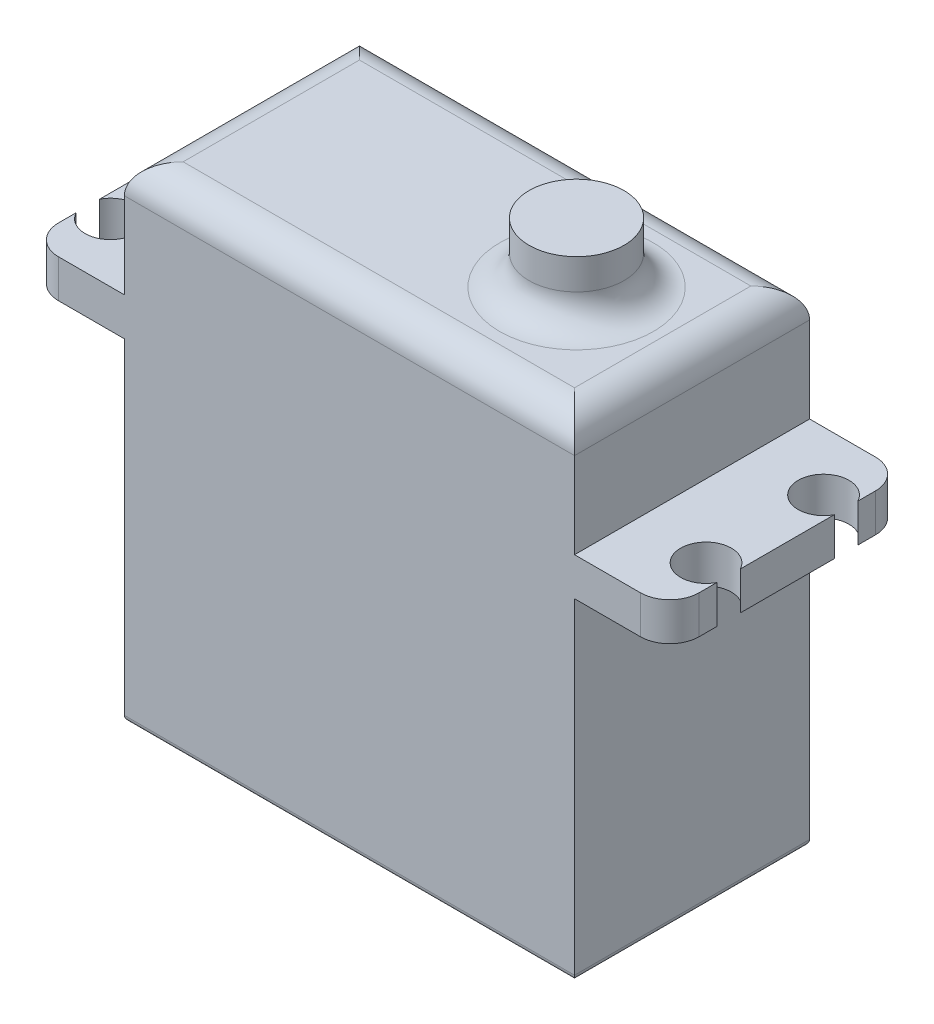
ISO-10303-21;
HEADER;
FILE_DESCRIPTION(('STEP AP214'),'2;1');
FILE_NAME('part.step','',(''),(''),'','','');
FILE_SCHEMA(('AUTOMOTIVE_DESIGN { 1 0 10303 214 1 1 1 1 }'));
ENDSEC;
DATA;
#1=APPLICATION_CONTEXT('core data for automotive mechanical design processes');
#2=APPLICATION_PROTOCOL_DEFINITION('international standard','automotive_design',2000,#1);
#3=PRODUCT_CONTEXT('',#1,'mechanical');
#4=PRODUCT('Part','Part','',(#3));
#5=PRODUCT_RELATED_PRODUCT_CATEGORY('part','',(#4));
#6=PRODUCT_DEFINITION_FORMATION('','',#4);
#7=PRODUCT_DEFINITION_CONTEXT('part definition',#1,'design');
#8=PRODUCT_DEFINITION('design','',#6,#7);
#9=PRODUCT_DEFINITION_SHAPE('','',#8);
#10=(LENGTH_UNIT() NAMED_UNIT(*) SI_UNIT(.MILLI.,.METRE.));
#11=(NAMED_UNIT(*) PLANE_ANGLE_UNIT() SI_UNIT($,.RADIAN.));
#12=(NAMED_UNIT(*) SI_UNIT($,.STERADIAN.) SOLID_ANGLE_UNIT());
#13=UNCERTAINTY_MEASURE_WITH_UNIT(LENGTH_MEASURE(1.E-05),#10,'distance_accuracy_value','');
#14=(GEOMETRIC_REPRESENTATION_CONTEXT(3) GLOBAL_UNCERTAINTY_ASSIGNED_CONTEXT((#13)) GLOBAL_UNIT_ASSIGNED_CONTEXT((#10,
#11,#12)) REPRESENTATION_CONTEXT('',''));
#15=CARTESIAN_POINT('',(0.,0.,0.));
#16=DIRECTION('',(0.,0.,1.));
#17=DIRECTION('',(1.,0.,0.));
#18=AXIS2_PLACEMENT_3D('',#15,#16,#17);
#19=CARTESIAN_POINT('',(0.,-28.24,0.));
#20=DIRECTION('',(0.,-1.,0.));
#21=DIRECTION('',(0.,0.,-1.));
#22=AXIS2_PLACEMENT_3D('',#19,#20,#21);
#23=PLANE('',#22);
#24=CARTESIAN_POINT('',(16.22,-28.24,6.97));
#25=DIRECTION('',(0.,-1.,0.));
#26=DIRECTION('',(0.,0.,-1.));
#27=AXIS2_PLACEMENT_3D('',#24,#25,#26);
#28=CIRCLE('',#27,2.03);
#29=CARTESIAN_POINT('',(14.19,-28.24,6.97));
#30=VERTEX_POINT('',#29);
#31=CARTESIAN_POINT('',(16.22,-28.24,4.94));
#32=VERTEX_POINT('',#31);
#33=EDGE_CURVE('E368',#30,#32,#28,.T.);
#34=ORIENTED_EDGE('',*,*,#33,.F.);
#35=DIRECTION('',(0.,0.,1.));
#36=VECTOR('',#35,1.);
#37=CARTESIAN_POINT('',(14.19,-28.24,0.));
#38=LINE('',#37,#36);
#39=CARTESIAN_POINT('',(14.19,-28.24,9.5));
#40=VERTEX_POINT('',#39);
#41=EDGE_CURVE('E378',#30,#40,#38,.T.);
#42=ORIENTED_EDGE('',*,*,#41,.T.);
#43=DIRECTION('',(-1.,0.,0.));
#44=VECTOR('',#43,1.);
#45=CARTESIAN_POINT('',(-19.15,-28.24,9.5));
#46=LINE('',#45,#44);
#47=CARTESIAN_POINT('',(-14.19,-28.24,9.5));
#48=VERTEX_POINT('',#47);
#49=EDGE_CURVE('E719',#40,#48,#46,.T.);
#50=ORIENTED_EDGE('',*,*,#49,.T.);
#51=DIRECTION('',(0.,0.,1.));
#52=VECTOR('',#51,1.);
#53=CARTESIAN_POINT('',(-14.19,-28.24,0.));
#54=LINE('',#53,#52);
#55=CARTESIAN_POINT('',(-14.19,-28.24,7.07));
#56=VERTEX_POINT('',#55);
#57=EDGE_CURVE('E94',#56,#48,#54,.T.);
#58=ORIENTED_EDGE('',*,*,#57,.F.);
#59=CARTESIAN_POINT('',(-16.22,-28.24,7.07));
#60=DIRECTION('',(0.,-1.,0.));
#61=DIRECTION('',(0.,0.,-1.));
#62=AXIS2_PLACEMENT_3D('',#59,#60,#61);
#63=CIRCLE('',#62,2.03);
#64=CARTESIAN_POINT('',(-16.22,-28.24,5.04));
#65=VERTEX_POINT('',#64);
#66=EDGE_CURVE('E421',#65,#56,#63,.T.);
#67=ORIENTED_EDGE('',*,*,#66,.F.);
#68=DIRECTION('',(1.,0.,0.));
#69=VECTOR('',#68,1.);
#70=CARTESIAN_POINT('',(0.,-28.24,5.04));
#71=LINE('',#70,#69);
#72=CARTESIAN_POINT('',(-18.65,-28.24,5.04));
#73=VERTEX_POINT('',#72);
#74=EDGE_CURVE('E454',#73,#65,#71,.T.);
#75=ORIENTED_EDGE('',*,*,#74,.F.);
#76=DIRECTION('',(0.,0.,-1.));
#77=VECTOR('',#76,1.);
#78=CARTESIAN_POINT('',(-18.65,-28.24,0.));
#79=LINE('',#78,#77);
#80=CARTESIAN_POINT('',(-18.65,-28.24,-5.04));
#81=VERTEX_POINT('',#80);
#82=EDGE_CURVE('E698',#73,#81,#79,.T.);
#83=ORIENTED_EDGE('',*,*,#82,.T.);
#84=DIRECTION('',(1.,0.,0.));
#85=VECTOR('',#84,1.);
#86=CARTESIAN_POINT('',(0.,-28.24,-5.04));
#87=LINE('',#86,#85);
#88=CARTESIAN_POINT('',(-16.22,-28.24,-5.04));
#89=VERTEX_POINT('',#88);
#90=EDGE_CURVE('E86',#81,#89,#87,.T.);
#91=ORIENTED_EDGE('',*,*,#90,.T.);
#92=CARTESIAN_POINT('',(-16.22,-28.24,-7.07));
#93=DIRECTION('',(0.,-1.,0.));
#94=DIRECTION('',(0.,0.,-1.));
#95=AXIS2_PLACEMENT_3D('',#92,#93,#94);
#96=CIRCLE('',#95,2.03);
#97=CARTESIAN_POINT('',(-14.19,-28.24,-7.07));
#98=VERTEX_POINT('',#97);
#99=EDGE_CURVE('E427',#98,#89,#96,.T.);
#100=ORIENTED_EDGE('',*,*,#99,.F.);
#101=DIRECTION('',(0.,0.,-1.));
#102=VECTOR('',#101,1.);
#103=CARTESIAN_POINT('',(-14.19,-28.24,0.));
#104=LINE('',#103,#102);
#105=CARTESIAN_POINT('',(-14.19,-28.24,-9.5));
#106=VERTEX_POINT('',#105);
#107=EDGE_CURVE('E375',#98,#106,#104,.T.);
#108=ORIENTED_EDGE('',*,*,#107,.T.);
#109=DIRECTION('',(1.,0.,0.));
#110=VECTOR('',#109,1.);
#111=CARTESIAN_POINT('',(0.,-28.24,-9.5));
#112=LINE('',#111,#110);
#113=CARTESIAN_POINT('',(14.19,-28.24,-9.5));
#114=VERTEX_POINT('',#113);
#115=EDGE_CURVE('E711',#106,#114,#112,.T.);
#116=ORIENTED_EDGE('',*,*,#115,.T.);
#117=DIRECTION('',(0.,0.,1.));
#118=VECTOR('',#117,1.);
#119=CARTESIAN_POINT('',(14.19,-28.24,0.));
#120=LINE('',#119,#118);
#121=CARTESIAN_POINT('',(14.19,-28.24,-7.07));
#122=VERTEX_POINT('',#121);
#123=EDGE_CURVE('E494',#114,#122,#120,.T.);
#124=ORIENTED_EDGE('',*,*,#123,.T.);
#125=CARTESIAN_POINT('',(16.22,-28.24,-7.07));
#126=DIRECTION('',(0.,-1.,0.));
#127=DIRECTION('',(0.,0.,-1.));
#128=AXIS2_PLACEMENT_3D('',#125,#126,#127);
#129=CIRCLE('',#128,2.03);
#130=CARTESIAN_POINT('',(16.22,-28.24,-5.04));
#131=VERTEX_POINT('',#130);
#132=EDGE_CURVE('E393',#131,#122,#129,.T.);
#133=ORIENTED_EDGE('',*,*,#132,.F.);
#134=DIRECTION('',(1.,0.,0.));
#135=VECTOR('',#134,1.);
#136=CARTESIAN_POINT('',(0.,-28.24,-5.04));
#137=LINE('',#136,#135);
#138=CARTESIAN_POINT('',(18.65,-28.24,-5.04));
#139=VERTEX_POINT('',#138);
#140=EDGE_CURVE('E390',#131,#139,#137,.T.);
#141=ORIENTED_EDGE('',*,*,#140,.T.);
#142=DIRECTION('',(0.,0.,1.));
#143=VECTOR('',#142,1.);
#144=CARTESIAN_POINT('',(18.65,-28.24,10.));
#145=LINE('',#144,#143);
#146=CARTESIAN_POINT('',(18.65,-28.24,4.94));
#147=VERTEX_POINT('',#146);
#148=EDGE_CURVE('E715',#139,#147,#145,.T.);
#149=ORIENTED_EDGE('',*,*,#148,.T.);
#150=DIRECTION('',(-1.,0.,0.));
#151=VECTOR('',#150,1.);
#152=CARTESIAN_POINT('',(0.,-28.24,4.94));
#153=LINE('',#152,#151);
#154=EDGE_CURVE('E389',#147,#32,#153,.T.);
#155=ORIENTED_EDGE('',*,*,#154,.T.);
#156=EDGE_LOOP('',(#34,#42,#50,#58,#67,#75,#83,#91,#100,#108,#116,#124,#133,#141,#149,#155));
#157=FACE_BOUND('',#156,.T.);
#158=ADVANCED_FACE('F69',(#157),#23,.T.);
#159=CARTESIAN_POINT('',(0.,0.,0.));
#160=DIRECTION('',(0.,1.,0.));
#161=DIRECTION('',(0.,0.,1.));
#162=AXIS2_PLACEMENT_3D('',#159,#160,#161);
#163=PLANE('',#162);
#164=DIRECTION('',(0.,0.,1.));
#165=VECTOR('',#164,1.);
#166=CARTESIAN_POINT('',(19.15,0.,0.));
#167=LINE('',#166,#165);
#168=CARTESIAN_POINT('',(19.15,0.,-10.));
#169=VERTEX_POINT('',#168);
#170=CARTESIAN_POINT('',(19.15,0.,10.));
#171=VERTEX_POINT('',#170);
#172=EDGE_CURVE('E510',#169,#171,#167,.T.);
#173=ORIENTED_EDGE('',*,*,#172,.F.);
#174=DIRECTION('',(1.,0.,0.));
#175=VECTOR('',#174,1.);
#176=CARTESIAN_POINT('',(0.,0.,-10.));
#177=LINE('',#176,#175);
#178=CARTESIAN_POINT('',(24.75,0.,-10.));
#179=VERTEX_POINT('',#178);
#180=EDGE_CURVE('E645',#169,#179,#177,.T.);
#181=ORIENTED_EDGE('',*,*,#180,.T.);
#182=CARTESIAN_POINT('',(24.75,0.,-7.5));
#183=DIRECTION('',(0.,1.,0.));
#184=DIRECTION('',(0.,0.,1.));
#185=AXIS2_PLACEMENT_3D('',#182,#183,#184);
#186=CIRCLE('',#185,2.5);
#187=CARTESIAN_POINT('',(27.25,0.,-7.5));
#188=VERTEX_POINT('',#187);
#189=EDGE_CURVE('E533',#188,#179,#186,.T.);
#190=ORIENTED_EDGE('',*,*,#189,.F.);
#191=DIRECTION('',(0.,0.,1.));
#192=VECTOR('',#191,1.);
#193=CARTESIAN_POINT('',(27.2500000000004,0.,-1.32359401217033E-12));
#194=LINE('',#193,#192);
#195=CARTESIAN_POINT('',(27.2500000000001,0.,-6.00000000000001));
#196=VERTEX_POINT('',#195);
#197=EDGE_CURVE('E573',#188,#196,#194,.T.);
#198=ORIENTED_EDGE('',*,*,#197,.T.);
#199=CARTESIAN_POINT('',(25.3354243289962,0.,-5.));
#200=DIRECTION('',(0.,1.,0.));
#201=DIRECTION('',(0.,0.,1.));
#202=AXIS2_PLACEMENT_3D('',#199,#200,#201);
#203=CIRCLE('',#202,2.16);
#204=CARTESIAN_POINT('',(27.2500000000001,0.,-4.));
#205=VERTEX_POINT('',#204);
#206=EDGE_CURVE('E570',#196,#205,#203,.T.);
#207=ORIENTED_EDGE('',*,*,#206,.T.);
#208=DIRECTION('',(0.,0.,1.));
#209=VECTOR('',#208,1.);
#210=CARTESIAN_POINT('',(27.25,0.,2.24538269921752E-13));
#211=LINE('',#210,#209);
#212=CARTESIAN_POINT('',(27.25,0.,3.99999999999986));
#213=VERTEX_POINT('',#212);
#214=EDGE_CURVE('E567',#205,#213,#211,.T.);
#215=ORIENTED_EDGE('',*,*,#214,.T.);
#216=CARTESIAN_POINT('',(25.3354243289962,0.,5.));
#217=DIRECTION('',(0.,1.,0.));
#218=DIRECTION('',(0.,0.,1.));
#219=AXIS2_PLACEMENT_3D('',#216,#217,#218);
#220=CIRCLE('',#219,2.16);
#221=CARTESIAN_POINT('',(27.25,0.,6.00000000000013));
#222=VERTEX_POINT('',#221);
#223=EDGE_CURVE('E564',#213,#222,#220,.T.);
#224=ORIENTED_EDGE('',*,*,#223,.T.);
#225=DIRECTION('',(0.,0.,1.));
#226=VECTOR('',#225,1.);
#227=CARTESIAN_POINT('',(27.25,0.,0.));
#228=LINE('',#227,#226);
#229=CARTESIAN_POINT('',(27.25,0.,7.5));
#230=VERTEX_POINT('',#229);
#231=EDGE_CURVE('E561',#222,#230,#228,.T.);
#232=ORIENTED_EDGE('',*,*,#231,.T.);
#233=CARTESIAN_POINT('',(24.75,0.,7.5));
#234=DIRECTION('',(0.,1.,0.));
#235=DIRECTION('',(0.,0.,1.));
#236=AXIS2_PLACEMENT_3D('',#233,#234,#235);
#237=CIRCLE('',#236,2.5);
#238=CARTESIAN_POINT('',(24.75,0.,10.));
#239=VERTEX_POINT('',#238);
#240=EDGE_CURVE('E528',#239,#230,#237,.T.);
#241=ORIENTED_EDGE('',*,*,#240,.F.);
#242=DIRECTION('',(1.,0.,0.));
#243=VECTOR('',#242,1.);
#244=CARTESIAN_POINT('',(0.,0.,10.));
#245=LINE('',#244,#243);
#246=EDGE_CURVE('E641',#171,#239,#245,.T.);
#247=ORIENTED_EDGE('',*,*,#246,.F.);
#248=EDGE_LOOP('',(#173,#181,#190,#198,#207,#215,#224,#232,#241,#247));
#249=FACE_BOUND('',#248,.T.);
#250=ADVANCED_FACE('F824',(#249),#163,.F.);
#251=CARTESIAN_POINT('',(-27.25,3.24,0.));
#252=DIRECTION('',(1.,0.,0.));
#253=DIRECTION('',(0.,0.,-1.));
#254=AXIS2_PLACEMENT_3D('',#251,#252,#253);
#255=PLANE('',#254);
#256=DIRECTION('',(0.,0.,1.));
#257=VECTOR('',#256,1.);
#258=CARTESIAN_POINT('',(-27.25,0.,0.));
#259=LINE('',#258,#257);
#260=CARTESIAN_POINT('',(-27.25,0.,-4.));
#261=VERTEX_POINT('',#260);
#262=CARTESIAN_POINT('',(-27.25,0.,4.00000000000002));
#263=VERTEX_POINT('',#262);
#264=EDGE_CURVE('E603',#261,#263,#259,.T.);
#265=ORIENTED_EDGE('',*,*,#264,.T.);
#266=DIRECTION('',(0.,-1.,0.));
#267=VECTOR('',#266,1.);
#268=CARTESIAN_POINT('',(-27.25,3.24,4.00000000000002));
#269=LINE('',#268,#267);
#270=CARTESIAN_POINT('',(-27.25,3.24,4.00000000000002));
#271=VERTEX_POINT('',#270);
#272=EDGE_CURVE('E671',#271,#263,#269,.T.);
#273=ORIENTED_EDGE('',*,*,#272,.F.);
#274=DIRECTION('',(0.,0.,1.));
#275=VECTOR('',#274,1.);
#276=CARTESIAN_POINT('',(-27.25,3.24,0.));
#277=LINE('',#276,#275);
#278=CARTESIAN_POINT('',(-27.25,3.24,-4.));
#279=VERTEX_POINT('',#278);
#280=EDGE_CURVE('E604',#279,#271,#277,.T.);
#281=ORIENTED_EDGE('',*,*,#280,.F.);
#282=DIRECTION('',(0.,-1.,0.));
#283=VECTOR('',#282,1.);
#284=CARTESIAN_POINT('',(-27.25,3.24,-4.));
#285=LINE('',#284,#283);
#286=EDGE_CURVE('E630',#279,#261,#285,.T.);
#287=ORIENTED_EDGE('',*,*,#286,.T.);
#288=EDGE_LOOP('',(#265,#273,#281,#287));
#289=FACE_BOUND('',#288,.T.);
#290=ADVANCED_FACE('F829',(#289),#255,.F.);
#291=CARTESIAN_POINT('',(-25.3354243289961,3.24,5.00000000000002));
#292=DIRECTION('',(0.,-1.,0.));
#293=DIRECTION('',(0.,0.,-1.));
#294=AXIS2_PLACEMENT_3D('',#291,#292,#293);
#295=CYLINDRICAL_SURFACE('',#294,2.16);
#296=CARTESIAN_POINT('',(-25.3354243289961,0.,5.00000000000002));
#297=DIRECTION('',(0.,1.,0.));
#298=DIRECTION('',(0.,0.,1.));
#299=AXIS2_PLACEMENT_3D('',#296,#297,#298);
#300=CIRCLE('',#299,2.16);
#301=CARTESIAN_POINT('',(-27.25,0.,6.00000000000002));
#302=VERTEX_POINT('',#301);
#303=EDGE_CURVE('E633',#263,#302,#300,.F.);
#304=ORIENTED_EDGE('',*,*,#303,.T.);
#305=DIRECTION('',(0.,-1.,0.));
#306=VECTOR('',#305,1.);
#307=CARTESIAN_POINT('',(-27.25,3.24,6.00000000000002));
#308=LINE('',#307,#306);
#309=CARTESIAN_POINT('',(-27.25,3.24,6.00000000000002));
#310=VERTEX_POINT('',#309);
#311=EDGE_CURVE('E668',#310,#302,#308,.T.);
#312=ORIENTED_EDGE('',*,*,#311,.F.);
#313=CARTESIAN_POINT('',(-25.3354243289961,3.24,5.00000000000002));
#314=DIRECTION('',(0.,1.,0.));
#315=DIRECTION('',(0.,0.,1.));
#316=AXIS2_PLACEMENT_3D('',#313,#314,#315);
#317=CIRCLE('',#316,2.16);
#318=EDGE_CURVE('E607',#271,#310,#317,.F.);
#319=ORIENTED_EDGE('',*,*,#318,.F.);
#320=ORIENTED_EDGE('',*,*,#272,.T.);
#321=EDGE_LOOP('',(#304,#312,#319,#320));
#322=FACE_BOUND('',#321,.T.);
#323=ADVANCED_FACE('F912',(#322),#295,.F.);
#324=CARTESIAN_POINT('',(-27.25,3.24,0.));
#325=DIRECTION('',(1.,0.,0.));
#326=DIRECTION('',(0.,0.,-1.));
#327=AXIS2_PLACEMENT_3D('',#324,#325,#326);
#328=PLANE('',#327);
#329=DIRECTION('',(0.,0.,1.));
#330=VECTOR('',#329,1.);
#331=CARTESIAN_POINT('',(-27.25,0.,0.));
#332=LINE('',#331,#330);
#333=CARTESIAN_POINT('',(-27.25,0.,7.5));
#334=VERTEX_POINT('',#333);
#335=EDGE_CURVE('E635',#302,#334,#332,.T.);
#336=ORIENTED_EDGE('',*,*,#335,.T.);
#337=DIRECTION('',(0.,-1.,0.));
#338=VECTOR('',#337,1.);
#339=CARTESIAN_POINT('',(-27.25,3.24,7.5));
#340=LINE('',#339,#338);
#341=CARTESIAN_POINT('',(-27.25,3.24,7.5));
#342=VERTEX_POINT('',#341);
#343=EDGE_CURVE('E666',#342,#334,#340,.T.);
#344=ORIENTED_EDGE('',*,*,#343,.F.);
#345=DIRECTION('',(0.,0.,1.));
#346=VECTOR('',#345,1.);
#347=CARTESIAN_POINT('',(-27.25,3.24,0.));
#348=LINE('',#347,#346);
#349=EDGE_CURVE('E610',#310,#342,#348,.T.);
#350=ORIENTED_EDGE('',*,*,#349,.F.);
#351=ORIENTED_EDGE('',*,*,#311,.T.);
#352=EDGE_LOOP('',(#336,#344,#350,#351));
#353=FACE_BOUND('',#352,.T.);
#354=ADVANCED_FACE('F908',(#353),#328,.F.);
#355=CARTESIAN_POINT('',(-24.75,3.24,7.5));
#356=DIRECTION('',(0.,-1.,0.));
#357=DIRECTION('',(0.,0.,-1.));
#358=AXIS2_PLACEMENT_3D('',#355,#356,#357);
#359=CYLINDRICAL_SURFACE('',#358,2.5);
#360=CARTESIAN_POINT('',(-24.75,0.,7.5));
#361=DIRECTION('',(0.,1.,0.));
#362=DIRECTION('',(0.,0.,1.));
#363=AXIS2_PLACEMENT_3D('',#360,#361,#362);
#364=CIRCLE('',#363,2.5);
#365=CARTESIAN_POINT('',(-24.75,0.,10.));
#366=VERTEX_POINT('',#365);
#367=EDGE_CURVE('E638',#366,#334,#364,.F.);
#368=ORIENTED_EDGE('',*,*,#367,.F.);
#369=DIRECTION('',(0.,-1.,0.));
#370=VECTOR('',#369,1.);
#371=CARTESIAN_POINT('',(-24.75,3.24,10.));
#372=LINE('',#371,#370);
#373=CARTESIAN_POINT('',(-24.75,3.24,10.));
#374=VERTEX_POINT('',#373);
#375=EDGE_CURVE('E664',#374,#366,#372,.T.);
#376=ORIENTED_EDGE('',*,*,#375,.F.);
#377=CARTESIAN_POINT('',(-24.75,3.24,7.5));
#378=DIRECTION('',(0.,1.,0.));
#379=DIRECTION('',(0.,0.,1.));
#380=AXIS2_PLACEMENT_3D('',#377,#378,#379);
#381=CIRCLE('',#380,2.5);
#382=EDGE_CURVE('E612',#374,#342,#381,.F.);
#383=ORIENTED_EDGE('',*,*,#382,.T.);
#384=ORIENTED_EDGE('',*,*,#343,.T.);
#385=EDGE_LOOP('',(#368,#376,#383,#384));
#386=FACE_BOUND('',#385,.T.);
#387=ADVANCED_FACE('F905',(#386),#359,.T.);
#388=CARTESIAN_POINT('',(0.,3.24,10.));
#389=DIRECTION('',(0.,0.,-1.));
#390=DIRECTION('',(-1.,0.,0.));
#391=AXIS2_PLACEMENT_3D('',#388,#389,#390);
#392=PLANE('',#391);
#393=DIRECTION('',(0.,1.,0.));
#394=VECTOR('',#393,1.);
#395=CARTESIAN_POINT('',(-19.15,-16.74,10.));
#396=LINE('',#395,#394);
#397=CARTESIAN_POINT('',(-19.15,-27.74,10.));
#398=VERTEX_POINT('',#397);
#399=CARTESIAN_POINT('',(-19.15,0.,10.));
#400=VERTEX_POINT('',#399);
#401=EDGE_CURVE('E521',#398,#400,#396,.T.);
#402=ORIENTED_EDGE('',*,*,#401,.F.);
#403=DIRECTION('',(-1.,0.,0.));
#404=VECTOR('',#403,1.);
#405=CARTESIAN_POINT('',(19.15,-27.74,10.));
#406=LINE('',#405,#404);
#407=CARTESIAN_POINT('',(19.15,-27.74,10.));
#408=VERTEX_POINT('',#407);
#409=EDGE_CURVE('E722',#398,#408,#406,.F.);
#410=ORIENTED_EDGE('',*,*,#409,.T.);
#411=DIRECTION('',(0.,1.,0.));
#412=VECTOR('',#411,1.);
#413=CARTESIAN_POINT('',(19.15,-16.74,10.));
#414=LINE('',#413,#412);
#415=EDGE_CURVE('E518',#408,#171,#414,.T.);
#416=ORIENTED_EDGE('',*,*,#415,.T.);
#417=ORIENTED_EDGE('',*,*,#246,.T.);
#418=DIRECTION('',(0.,-1.,0.));
#419=VECTOR('',#418,1.);
#420=CARTESIAN_POINT('',(24.75,3.24,10.));
#421=LINE('',#420,#419);
#422=CARTESIAN_POINT('',(24.75,3.24,10.));
#423=VERTEX_POINT('',#422);
#424=EDGE_CURVE('E592',#423,#239,#421,.T.);
#425=ORIENTED_EDGE('',*,*,#424,.F.);
#426=DIRECTION('',(1.,0.,0.));
#427=VECTOR('',#426,1.);
#428=CARTESIAN_POINT('',(0.,3.24,10.));
#429=LINE('',#428,#427);
#430=CARTESIAN_POINT('',(19.15,3.24,10.));
#431=VERTEX_POINT('',#430);
#432=EDGE_CURVE('E529',#431,#423,#429,.T.);
#433=ORIENTED_EDGE('',*,*,#432,.F.);
#434=DIRECTION('',(0.,-1.,0.));
#435=VECTOR('',#434,1.);
#436=CARTESIAN_POINT('',(19.15,13.04,10.));
#437=LINE('',#436,#435);
#438=CARTESIAN_POINT('',(19.15,10.54,10.));
#439=VERTEX_POINT('',#438);
#440=EDGE_CURVE('E595',#439,#431,#437,.T.);
#441=ORIENTED_EDGE('',*,*,#440,.F.);
#442=DIRECTION('',(1.,0.,0.));
#443=VECTOR('',#442,1.);
#444=CARTESIAN_POINT('',(-19.15,10.54,10.));
#445=LINE('',#444,#443);
#446=CARTESIAN_POINT('',(-19.15,10.54,10.));
#447=VERTEX_POINT('',#446);
#448=EDGE_CURVE('E686',#439,#447,#445,.F.);
#449=ORIENTED_EDGE('',*,*,#448,.T.);
#450=DIRECTION('',(0.,-1.,0.));
#451=VECTOR('',#450,1.);
#452=CARTESIAN_POINT('',(-19.15,13.04,10.));
#453=LINE('',#452,#451);
#454=CARTESIAN_POINT('',(-19.15,3.24,10.));
#455=VERTEX_POINT('',#454);
#456=EDGE_CURVE('E597',#447,#455,#453,.T.);
#457=ORIENTED_EDGE('',*,*,#456,.T.);
#458=DIRECTION('',(1.,0.,0.));
#459=VECTOR('',#458,1.);
#460=CARTESIAN_POINT('',(0.,3.24,10.));
#461=LINE('',#460,#459);
#462=EDGE_CURVE('E615',#374,#455,#461,.T.);
#463=ORIENTED_EDGE('',*,*,#462,.F.);
#464=ORIENTED_EDGE('',*,*,#375,.T.);
#465=EDGE_CURVE('E642',#366,#400,#245,.T.);
#466=ORIENTED_EDGE('',*,*,#465,.T.);
#467=EDGE_LOOP('',(#402,#410,#416,#417,#425,#433,#441,#449,#457,#463,#464,#466));
#468=FACE_BOUND('',#467,.T.);
#469=ADVANCED_FACE('F808',(#468),#392,.F.);
#470=CARTESIAN_POINT('',(0.,3.24,-10.));
#471=DIRECTION('',(0.,0.,-1.));
#472=DIRECTION('',(-1.,0.,0.));
#473=AXIS2_PLACEMENT_3D('',#470,#471,#472);
#474=PLANE('',#473);
#475=DIRECTION('',(0.,1.,0.));
#476=VECTOR('',#475,1.);
#477=CARTESIAN_POINT('',(19.15,-16.74,-10.));
#478=LINE('',#477,#476);
#479=CARTESIAN_POINT('',(19.15,-27.74,-10.));
#480=VERTEX_POINT('',#479);
#481=EDGE_CURVE('E517',#480,#169,#478,.T.);
#482=ORIENTED_EDGE('',*,*,#481,.F.);
#483=DIRECTION('',(1.,0.,0.));
#484=VECTOR('',#483,1.);
#485=CARTESIAN_POINT('',(0.,-27.74,-10.));
#486=LINE('',#485,#484);
#487=CARTESIAN_POINT('',(-19.15,-27.74,-10.));
#488=VERTEX_POINT('',#487);
#489=EDGE_CURVE('E78',#480,#488,#486,.F.);
#490=ORIENTED_EDGE('',*,*,#489,.T.);
#491=DIRECTION('',(0.,1.,0.));
#492=VECTOR('',#491,1.);
#493=CARTESIAN_POINT('',(-19.15,-16.74,-10.));
#494=LINE('',#493,#492);
#495=CARTESIAN_POINT('',(-19.15,0.,-10.));
#496=VERTEX_POINT('',#495);
#497=EDGE_CURVE('E523',#488,#496,#494,.T.);
#498=ORIENTED_EDGE('',*,*,#497,.T.);
#499=CARTESIAN_POINT('',(-24.75,0.,-10.));
#500=VERTEX_POINT('',#499);
#501=EDGE_CURVE('E646',#500,#496,#177,.T.);
#502=ORIENTED_EDGE('',*,*,#501,.F.);
#503=DIRECTION('',(0.,-1.,0.));
#504=VECTOR('',#503,1.);
#505=CARTESIAN_POINT('',(-24.75,3.24,-10.));
#506=LINE('',#505,#504);
#507=CARTESIAN_POINT('',(-24.75,3.24,-10.));
#508=VERTEX_POINT('',#507);
#509=EDGE_CURVE('E662',#508,#500,#506,.T.);
#510=ORIENTED_EDGE('',*,*,#509,.F.);
#511=DIRECTION('',(1.,0.,0.));
#512=VECTOR('',#511,1.);
#513=CARTESIAN_POINT('',(0.,3.24,-10.));
#514=LINE('',#513,#512);
#515=CARTESIAN_POINT('',(-19.15,3.24,-10.));
#516=VERTEX_POINT('',#515);
#517=EDGE_CURVE('E621',#508,#516,#514,.T.);
#518=ORIENTED_EDGE('',*,*,#517,.T.);
#519=DIRECTION('',(0.,-1.,0.));
#520=VECTOR('',#519,1.);
#521=CARTESIAN_POINT('',(-19.15,13.04,-10.));
#522=LINE('',#521,#520);
#523=CARTESIAN_POINT('',(-19.15,10.54,-10.));
#524=VERTEX_POINT('',#523);
#525=EDGE_CURVE('E599',#524,#516,#522,.T.);
#526=ORIENTED_EDGE('',*,*,#525,.F.);
#527=DIRECTION('',(1.,0.,0.));
#528=VECTOR('',#527,1.);
#529=CARTESIAN_POINT('',(0.,10.54,-10.));
#530=LINE('',#529,#528);
#531=CARTESIAN_POINT('',(19.15,10.54,-10.));
#532=VERTEX_POINT('',#531);
#533=EDGE_CURVE('E691',#524,#532,#530,.T.);
#534=ORIENTED_EDGE('',*,*,#533,.T.);
#535=DIRECTION('',(0.,-1.,0.));
#536=VECTOR('',#535,1.);
#537=CARTESIAN_POINT('',(19.15,13.04,-10.));
#538=LINE('',#537,#536);
#539=CARTESIAN_POINT('',(19.15,3.24,-10.));
#540=VERTEX_POINT('',#539);
#541=EDGE_CURVE('E601',#532,#540,#538,.T.);
#542=ORIENTED_EDGE('',*,*,#541,.T.);
#543=DIRECTION('',(1.,0.,0.));
#544=VECTOR('',#543,1.);
#545=CARTESIAN_POINT('',(0.,3.24,-10.));
#546=LINE('',#545,#544);
#547=CARTESIAN_POINT('',(24.75,3.24,-10.));
#548=VERTEX_POINT('',#547);
#549=EDGE_CURVE('E552',#540,#548,#546,.T.);
#550=ORIENTED_EDGE('',*,*,#549,.T.);
#551=DIRECTION('',(0.,-1.,0.));
#552=VECTOR('',#551,1.);
#553=CARTESIAN_POINT('',(24.75,3.24,-10.));
#554=LINE('',#553,#552);
#555=EDGE_CURVE('E558',#548,#179,#554,.T.);
#556=ORIENTED_EDGE('',*,*,#555,.T.);
#557=ORIENTED_EDGE('',*,*,#180,.F.);
#558=EDGE_LOOP('',(#482,#490,#498,#502,#510,#518,#526,#534,#542,#550,#556,#557));
#559=FACE_BOUND('',#558,.T.);
#560=ADVANCED_FACE('F753',(#559),#474,.T.);
#561=CARTESIAN_POINT('',(-24.75,3.24,-7.5));
#562=DIRECTION('',(0.,-1.,0.));
#563=DIRECTION('',(0.,0.,-1.));
#564=AXIS2_PLACEMENT_3D('',#561,#562,#563);
#565=CYLINDRICAL_SURFACE('',#564,2.5);
#566=CARTESIAN_POINT('',(-24.75,0.,-7.5));
#567=DIRECTION('',(0.,1.,0.));
#568=DIRECTION('',(0.,0.,1.));
#569=AXIS2_PLACEMENT_3D('',#566,#567,#568);
#570=CIRCLE('',#569,2.5);
#571=CARTESIAN_POINT('',(-27.25,0.,-7.5));
#572=VERTEX_POINT('',#571);
#573=EDGE_CURVE('E649',#500,#572,#570,.T.);
#574=ORIENTED_EDGE('',*,*,#573,.T.);
#575=DIRECTION('',(0.,-1.,0.));
#576=VECTOR('',#575,1.);
#577=CARTESIAN_POINT('',(-27.25,3.24,-7.5));
#578=LINE('',#577,#576);
#579=CARTESIAN_POINT('',(-27.25,3.24,-7.5));
#580=VERTEX_POINT('',#579);
#581=EDGE_CURVE('E659',#580,#572,#578,.T.);
#582=ORIENTED_EDGE('',*,*,#581,.F.);
#583=CARTESIAN_POINT('',(-24.75,3.24,-7.5));
#584=DIRECTION('',(0.,1.,0.));
#585=DIRECTION('',(0.,0.,1.));
#586=AXIS2_PLACEMENT_3D('',#583,#584,#585);
#587=CIRCLE('',#586,2.5);
#588=EDGE_CURVE('E624',#508,#580,#587,.T.);
#589=ORIENTED_EDGE('',*,*,#588,.F.);
#590=ORIENTED_EDGE('',*,*,#509,.T.);
#591=EDGE_LOOP('',(#574,#582,#589,#590));
#592=FACE_BOUND('',#591,.T.);
#593=ADVANCED_FACE('F770',(#592),#565,.T.);
#594=CARTESIAN_POINT('',(-27.25,3.24,0.));
#595=DIRECTION('',(1.,0.,0.));
#596=DIRECTION('',(0.,0.,-1.));
#597=AXIS2_PLACEMENT_3D('',#594,#595,#596);
#598=PLANE('',#597);
#599=DIRECTION('',(0.,0.,1.));
#600=VECTOR('',#599,1.);
#601=CARTESIAN_POINT('',(-27.25,0.,0.));
#602=LINE('',#601,#600);
#603=CARTESIAN_POINT('',(-27.25,0.,-6.));
#604=VERTEX_POINT('',#603);
#605=EDGE_CURVE('E651',#572,#604,#602,.T.);
#606=ORIENTED_EDGE('',*,*,#605,.T.);
#607=DIRECTION('',(0.,-1.,0.));
#608=VECTOR('',#607,1.);
#609=CARTESIAN_POINT('',(-27.25,3.24,-6.));
#610=LINE('',#609,#608);
#611=CARTESIAN_POINT('',(-27.25,3.24,-6.));
#612=VERTEX_POINT('',#611);
#613=EDGE_CURVE('E656',#612,#604,#610,.T.);
#614=ORIENTED_EDGE('',*,*,#613,.F.);
#615=DIRECTION('',(0.,0.,1.));
#616=VECTOR('',#615,1.);
#617=CARTESIAN_POINT('',(-27.25,3.24,0.));
#618=LINE('',#617,#616);
#619=EDGE_CURVE('E626',#580,#612,#618,.T.);
#620=ORIENTED_EDGE('',*,*,#619,.F.);
#621=ORIENTED_EDGE('',*,*,#581,.T.);
#622=EDGE_LOOP('',(#606,#614,#620,#621));
#623=FACE_BOUND('',#622,.T.);
#624=ADVANCED_FACE('F894',(#623),#598,.F.);
#625=CARTESIAN_POINT('',(-25.3354243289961,3.24,-5.));
#626=DIRECTION('',(0.,-1.,0.));
#627=DIRECTION('',(0.,0.,-1.));
#628=AXIS2_PLACEMENT_3D('',#625,#626,#627);
#629=CYLINDRICAL_SURFACE('',#628,2.16);
#630=CARTESIAN_POINT('',(-25.3354243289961,0.,-5.));
#631=DIRECTION('',(0.,1.,0.));
#632=DIRECTION('',(0.,0.,1.));
#633=AXIS2_PLACEMENT_3D('',#630,#631,#632);
#634=CIRCLE('',#633,2.16);
#635=EDGE_CURVE('E608',#604,#261,#634,.F.);
#636=ORIENTED_EDGE('',*,*,#635,.T.);
#637=ORIENTED_EDGE('',*,*,#286,.F.);
#638=CARTESIAN_POINT('',(-25.3354243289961,3.24,-5.));
#639=DIRECTION('',(0.,1.,0.));
#640=DIRECTION('',(0.,0.,1.));
#641=AXIS2_PLACEMENT_3D('',#638,#639,#640);
#642=CIRCLE('',#641,2.16);
#643=EDGE_CURVE('E628',#612,#279,#642,.F.);
#644=ORIENTED_EDGE('',*,*,#643,.F.);
#645=ORIENTED_EDGE('',*,*,#613,.T.);
#646=EDGE_LOOP('',(#636,#637,#644,#645));
#647=FACE_BOUND('',#646,.T.);
#648=ADVANCED_FACE('F889',(#647),#629,.F.);
#649=CARTESIAN_POINT('',(0.,3.24,0.));
#650=DIRECTION('',(0.,1.,0.));
#651=DIRECTION('',(0.,0.,1.));
#652=AXIS2_PLACEMENT_3D('',#649,#650,#651);
#653=PLANE('',#652);
#654=ORIENTED_EDGE('',*,*,#280,.T.);
#655=ORIENTED_EDGE('',*,*,#318,.T.);
#656=ORIENTED_EDGE('',*,*,#349,.T.);
#657=ORIENTED_EDGE('',*,*,#382,.F.);
#658=ORIENTED_EDGE('',*,*,#462,.T.);
#659=DIRECTION('',(0.,0.,1.));
#660=VECTOR('',#659,1.);
#661=CARTESIAN_POINT('',(-19.15,3.24,0.));
#662=LINE('',#661,#660);
#663=EDGE_CURVE('E618',#516,#455,#662,.T.);
#664=ORIENTED_EDGE('',*,*,#663,.F.);
#665=ORIENTED_EDGE('',*,*,#517,.F.);
#666=ORIENTED_EDGE('',*,*,#588,.T.);
#667=ORIENTED_EDGE('',*,*,#619,.T.);
#668=ORIENTED_EDGE('',*,*,#643,.T.);
#669=EDGE_LOOP('',(#654,#655,#656,#657,#658,#664,#665,#666,#667,#668));
#670=FACE_BOUND('',#669,.T.);
#671=ADVANCED_FACE('F774',(#670),#653,.T.);
#672=ORIENTED_EDGE('',*,*,#501,.T.);
#673=DIRECTION('',(0.,0.,1.));
#674=VECTOR('',#673,1.);
#675=CARTESIAN_POINT('',(-19.15,0.,0.));
#676=LINE('',#675,#674);
#677=EDGE_CURVE('E513',#496,#400,#676,.T.);
#678=ORIENTED_EDGE('',*,*,#677,.T.);
#679=ORIENTED_EDGE('',*,*,#465,.F.);
#680=ORIENTED_EDGE('',*,*,#367,.T.);
#681=ORIENTED_EDGE('',*,*,#335,.F.);
#682=ORIENTED_EDGE('',*,*,#303,.F.);
#683=ORIENTED_EDGE('',*,*,#264,.F.);
#684=ORIENTED_EDGE('',*,*,#635,.F.);
#685=ORIENTED_EDGE('',*,*,#605,.F.);
#686=ORIENTED_EDGE('',*,*,#573,.F.);
#687=EDGE_LOOP('',(#672,#678,#679,#680,#681,#682,#683,#684,#685,#686));
#688=FACE_BOUND('',#687,.T.);
#689=ADVANCED_FACE('F763',(#688),#163,.F.);
#690=CARTESIAN_POINT('',(-19.15,13.04,0.));
#691=DIRECTION('',(1.,0.,0.));
#692=DIRECTION('',(0.,0.,-1.));
#693=AXIS2_PLACEMENT_3D('',#690,#691,#692);
#694=PLANE('',#693);
#695=ORIENTED_EDGE('',*,*,#456,.F.);
#696=DIRECTION('',(0.,0.,1.));
#697=VECTOR('',#696,1.);
#698=CARTESIAN_POINT('',(-19.15,10.54,-10.));
#699=LINE('',#698,#697);
#700=EDGE_CURVE('E689',#447,#524,#699,.F.);
#701=ORIENTED_EDGE('',*,*,#700,.T.);
#702=ORIENTED_EDGE('',*,*,#525,.T.);
#703=ORIENTED_EDGE('',*,*,#663,.T.);
#704=EDGE_LOOP('',(#695,#701,#702,#703));
#705=FACE_BOUND('',#704,.T.);
#706=ADVANCED_FACE('F779',(#705),#694,.F.);
#707=CARTESIAN_POINT('',(19.15,13.04,0.));
#708=DIRECTION('',(1.,0.,0.));
#709=DIRECTION('',(0.,0.,-1.));
#710=AXIS2_PLACEMENT_3D('',#707,#708,#709);
#711=PLANE('',#710);
#712=ORIENTED_EDGE('',*,*,#541,.F.);
#713=DIRECTION('',(0.,0.,1.));
#714=VECTOR('',#713,1.);
#715=CARTESIAN_POINT('',(19.15,10.54,0.));
#716=LINE('',#715,#714);
#717=EDGE_CURVE('E693',#532,#439,#716,.T.);
#718=ORIENTED_EDGE('',*,*,#717,.T.);
#719=ORIENTED_EDGE('',*,*,#440,.T.);
#720=DIRECTION('',(0.,0.,1.));
#721=VECTOR('',#720,1.);
#722=CARTESIAN_POINT('',(19.15,3.24,0.));
#723=LINE('',#722,#721);
#724=EDGE_CURVE('E555',#540,#431,#723,.T.);
#725=ORIENTED_EDGE('',*,*,#724,.F.);
#726=EDGE_LOOP('',(#712,#718,#719,#725));
#727=FACE_BOUND('',#726,.T.);
#728=ADVANCED_FACE('F803',(#727),#711,.T.);
#729=CARTESIAN_POINT('',(0.,13.04,0.));
#730=DIRECTION('',(0.,1.,0.));
#731=DIRECTION('',(0.,0.,1.));
#732=AXIS2_PLACEMENT_3D('',#729,#730,#731);
#733=PLANE('',#732);
#734=DIRECTION('',(0.,0.,1.));
#735=VECTOR('',#734,1.);
#736=CARTESIAN_POINT('',(-16.65,13.04,10.));
#737=LINE('',#736,#735);
#738=CARTESIAN_POINT('',(-16.65,13.04,-7.5));
#739=VERTEX_POINT('',#738);
#740=CARTESIAN_POINT('',(-16.65,13.04,7.5));
#741=VERTEX_POINT('',#740);
#742=EDGE_CURVE('E681',#739,#741,#737,.T.);
#743=ORIENTED_EDGE('',*,*,#742,.T.);
#744=DIRECTION('',(1.,0.,0.));
#745=VECTOR('',#744,1.);
#746=CARTESIAN_POINT('',(19.15,13.04,7.5));
#747=LINE('',#746,#745);
#748=CARTESIAN_POINT('',(16.65,13.04,7.5));
#749=VERTEX_POINT('',#748);
#750=EDGE_CURVE('E683',#741,#749,#747,.T.);
#751=ORIENTED_EDGE('',*,*,#750,.T.);
#752=DIRECTION('',(0.,0.,1.));
#753=VECTOR('',#752,1.);
#754=CARTESIAN_POINT('',(16.65,13.04,0.));
#755=LINE('',#754,#753);
#756=CARTESIAN_POINT('',(16.65,13.04,-7.5));
#757=VERTEX_POINT('',#756);
#758=EDGE_CURVE('E677',#749,#757,#755,.F.);
#759=ORIENTED_EDGE('',*,*,#758,.T.);
#760=DIRECTION('',(1.,0.,0.));
#761=VECTOR('',#760,1.);
#762=CARTESIAN_POINT('',(0.,13.04,-7.5));
#763=LINE('',#762,#761);
#764=EDGE_CURVE('E679',#757,#739,#763,.F.);
#765=ORIENTED_EDGE('',*,*,#764,.T.);
#766=EDGE_LOOP('',(#743,#751,#759,#765));
#767=FACE_BOUND('',#766,.T.);
#768=CARTESIAN_POINT('',(9.32,13.04,0.));
#769=DIRECTION('',(0.,1.,0.));
#770=DIRECTION('',(0.,0.,1.));
#771=AXIS2_PLACEMENT_3D('',#768,#769,#770);
#772=CIRCLE('',#771,6.54);
#773=CARTESIAN_POINT('',(9.32,13.04,6.54));
#774=VERTEX_POINT('',#773);
#775=EDGE_CURVE('E674',#774,#774,#772,.F.);
#776=ORIENTED_EDGE('',*,*,#775,.T.);
#777=EDGE_LOOP('',(#776));
#778=FACE_BOUND('',#777,.T.);
#779=ADVANCED_FACE('F795',(#767,#778),#733,.T.);
#780=CARTESIAN_POINT('',(24.75,3.24,7.5));
#781=DIRECTION('',(0.,-1.,0.));
#782=DIRECTION('',(0.,0.,-1.));
#783=AXIS2_PLACEMENT_3D('',#780,#781,#782);
#784=CYLINDRICAL_SURFACE('',#783,2.5);
#785=ORIENTED_EDGE('',*,*,#240,.T.);
#786=DIRECTION('',(0.,-1.,0.));
#787=VECTOR('',#786,1.);
#788=CARTESIAN_POINT('',(27.25,3.24,7.5));
#789=LINE('',#788,#787);
#790=CARTESIAN_POINT('',(27.25,3.24,7.5));
#791=VERTEX_POINT('',#790);
#792=EDGE_CURVE('E590',#791,#230,#789,.T.);
#793=ORIENTED_EDGE('',*,*,#792,.F.);
#794=CARTESIAN_POINT('',(24.75,3.24,7.5));
#795=DIRECTION('',(0.,1.,0.));
#796=DIRECTION('',(0.,0.,1.));
#797=AXIS2_PLACEMENT_3D('',#794,#795,#796);
#798=CIRCLE('',#797,2.5);
#799=EDGE_CURVE('E532',#423,#791,#798,.T.);
#800=ORIENTED_EDGE('',*,*,#799,.F.);
#801=ORIENTED_EDGE('',*,*,#424,.T.);
#802=EDGE_LOOP('',(#785,#793,#800,#801));
#803=FACE_BOUND('',#802,.T.);
#804=ADVANCED_FACE('F877',(#803),#784,.T.);
#805=CARTESIAN_POINT('',(27.25,3.24,0.));
#806=DIRECTION('',(1.,0.,0.));
#807=DIRECTION('',(0.,0.,-1.));
#808=AXIS2_PLACEMENT_3D('',#805,#806,#807);
#809=PLANE('',#808);
#810=ORIENTED_EDGE('',*,*,#231,.F.);
#811=DIRECTION('',(0.,-1.,0.));
#812=VECTOR('',#811,1.);
#813=CARTESIAN_POINT('',(27.25,3.24,6.00000000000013));
#814=LINE('',#813,#812);
#815=CARTESIAN_POINT('',(27.25,3.24,6.00000000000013));
#816=VERTEX_POINT('',#815);
#817=EDGE_CURVE('E588',#816,#222,#814,.T.);
#818=ORIENTED_EDGE('',*,*,#817,.F.);
#819=DIRECTION('',(0.,0.,1.));
#820=VECTOR('',#819,1.);
#821=CARTESIAN_POINT('',(27.25,3.24,0.));
#822=LINE('',#821,#820);
#823=EDGE_CURVE('E535',#816,#791,#822,.T.);
#824=ORIENTED_EDGE('',*,*,#823,.T.);
#825=ORIENTED_EDGE('',*,*,#792,.T.);
#826=EDGE_LOOP('',(#810,#818,#824,#825));
#827=FACE_BOUND('',#826,.T.);
#828=ADVANCED_FACE('F873',(#827),#809,.T.);
#829=CARTESIAN_POINT('',(25.3354243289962,3.24,5.));
#830=DIRECTION('',(0.,-1.,0.));
#831=DIRECTION('',(0.,0.,-1.));
#832=AXIS2_PLACEMENT_3D('',#829,#830,#831);
#833=CYLINDRICAL_SURFACE('',#832,2.16);
#834=ORIENTED_EDGE('',*,*,#223,.F.);
#835=DIRECTION('',(0.,-1.,0.));
#836=VECTOR('',#835,1.);
#837=CARTESIAN_POINT('',(27.25,3.24,3.99999999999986));
#838=LINE('',#837,#836);
#839=CARTESIAN_POINT('',(27.25,3.24,3.99999999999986));
#840=VERTEX_POINT('',#839);
#841=EDGE_CURVE('E586',#840,#213,#838,.T.);
#842=ORIENTED_EDGE('',*,*,#841,.F.);
#843=CARTESIAN_POINT('',(25.3354243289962,3.24,5.));
#844=DIRECTION('',(0.,1.,0.));
#845=DIRECTION('',(0.,0.,1.));
#846=AXIS2_PLACEMENT_3D('',#843,#844,#845);
#847=CIRCLE('',#846,2.16);
#848=EDGE_CURVE('E538',#840,#816,#847,.T.);
#849=ORIENTED_EDGE('',*,*,#848,.T.);
#850=ORIENTED_EDGE('',*,*,#817,.T.);
#851=EDGE_LOOP('',(#834,#842,#849,#850));
#852=FACE_BOUND('',#851,.T.);
#853=ADVANCED_FACE('F869',(#852),#833,.F.);
#854=CARTESIAN_POINT('',(27.25,3.24,2.24538269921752E-13));
#855=DIRECTION('',(1.,0.,0.));
#856=DIRECTION('',(0.,0.,-1.));
#857=AXIS2_PLACEMENT_3D('',#854,#855,#856);
#858=PLANE('',#857);
#859=ORIENTED_EDGE('',*,*,#214,.F.);
#860=DIRECTION('',(0.,-1.,0.));
#861=VECTOR('',#860,1.);
#862=CARTESIAN_POINT('',(27.2500000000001,3.24,-4.));
#863=LINE('',#862,#861);
#864=CARTESIAN_POINT('',(27.2500000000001,3.24,-4.));
#865=VERTEX_POINT('',#864);
#866=EDGE_CURVE('E584',#865,#205,#863,.T.);
#867=ORIENTED_EDGE('',*,*,#866,.F.);
#868=DIRECTION('',(0.,0.,1.));
#869=VECTOR('',#868,1.);
#870=CARTESIAN_POINT('',(27.25,3.24,2.24538269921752E-13));
#871=LINE('',#870,#869);
#872=EDGE_CURVE('E541',#865,#840,#871,.T.);
#873=ORIENTED_EDGE('',*,*,#872,.T.);
#874=ORIENTED_EDGE('',*,*,#841,.T.);
#875=EDGE_LOOP('',(#859,#867,#873,#874));
#876=FACE_BOUND('',#875,.T.);
#877=ADVANCED_FACE('F865',(#876),#858,.T.);
#878=CARTESIAN_POINT('',(25.3354243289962,3.24,-5.));
#879=DIRECTION('',(0.,-1.,0.));
#880=DIRECTION('',(0.,0.,-1.));
#881=AXIS2_PLACEMENT_3D('',#878,#879,#880);
#882=CYLINDRICAL_SURFACE('',#881,2.16);
#883=ORIENTED_EDGE('',*,*,#206,.F.);
#884=DIRECTION('',(0.,-1.,0.));
#885=VECTOR('',#884,1.);
#886=CARTESIAN_POINT('',(27.2500000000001,3.24,-6.00000000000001));
#887=LINE('',#886,#885);
#888=CARTESIAN_POINT('',(27.2500000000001,3.24,-6.00000000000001));
#889=VERTEX_POINT('',#888);
#890=EDGE_CURVE('E582',#889,#196,#887,.T.);
#891=ORIENTED_EDGE('',*,*,#890,.F.);
#892=CARTESIAN_POINT('',(25.3354243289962,3.24,-5.));
#893=DIRECTION('',(0.,1.,0.));
#894=DIRECTION('',(0.,0.,1.));
#895=AXIS2_PLACEMENT_3D('',#892,#893,#894);
#896=CIRCLE('',#895,2.16);
#897=EDGE_CURVE('E544',#889,#865,#896,.T.);
#898=ORIENTED_EDGE('',*,*,#897,.T.);
#899=ORIENTED_EDGE('',*,*,#866,.T.);
#900=EDGE_LOOP('',(#883,#891,#898,#899));
#901=FACE_BOUND('',#900,.T.);
#902=ADVANCED_FACE('F861',(#901),#882,.F.);
#903=CARTESIAN_POINT('',(27.2500000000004,3.24,-1.32359401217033E-12));
#904=DIRECTION('',(1.,0.,0.));
#905=DIRECTION('',(0.,0.,-1.));
#906=AXIS2_PLACEMENT_3D('',#903,#904,#905);
#907=PLANE('',#906);
#908=ORIENTED_EDGE('',*,*,#197,.F.);
#909=DIRECTION('',(0.,-1.,0.));
#910=VECTOR('',#909,1.);
#911=CARTESIAN_POINT('',(27.25,3.24,-7.5));
#912=LINE('',#911,#910);
#913=CARTESIAN_POINT('',(27.25,3.24,-7.5));
#914=VERTEX_POINT('',#913);
#915=EDGE_CURVE('E580',#914,#188,#912,.T.);
#916=ORIENTED_EDGE('',*,*,#915,.F.);
#917=DIRECTION('',(0.,0.,1.));
#918=VECTOR('',#917,1.);
#919=CARTESIAN_POINT('',(27.2500000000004,3.24,-1.32359401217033E-12));
#920=LINE('',#919,#918);
#921=EDGE_CURVE('E547',#914,#889,#920,.T.);
#922=ORIENTED_EDGE('',*,*,#921,.T.);
#923=ORIENTED_EDGE('',*,*,#890,.T.);
#924=EDGE_LOOP('',(#908,#916,#922,#923));
#925=FACE_BOUND('',#924,.T.);
#926=ADVANCED_FACE('F857',(#925),#907,.T.);
#927=CARTESIAN_POINT('',(24.75,3.24,-7.5));
#928=DIRECTION('',(0.,-1.,0.));
#929=DIRECTION('',(0.,0.,-1.));
#930=AXIS2_PLACEMENT_3D('',#927,#928,#929);
#931=CYLINDRICAL_SURFACE('',#930,2.5);
#932=ORIENTED_EDGE('',*,*,#189,.T.);
#933=ORIENTED_EDGE('',*,*,#555,.F.);
#934=CARTESIAN_POINT('',(24.75,3.24,-7.5));
#935=DIRECTION('',(0.,1.,0.));
#936=DIRECTION('',(0.,0.,1.));
#937=AXIS2_PLACEMENT_3D('',#934,#935,#936);
#938=CIRCLE('',#937,2.5);
#939=EDGE_CURVE('E550',#914,#548,#938,.T.);
#940=ORIENTED_EDGE('',*,*,#939,.F.);
#941=ORIENTED_EDGE('',*,*,#915,.T.);
#942=EDGE_LOOP('',(#932,#933,#940,#941));
#943=FACE_BOUND('',#942,.T.);
#944=ADVANCED_FACE('F853',(#943),#931,.T.);
#945=CARTESIAN_POINT('',(0.,3.24,0.));
#946=DIRECTION('',(0.,1.,0.));
#947=DIRECTION('',(0.,0.,1.));
#948=AXIS2_PLACEMENT_3D('',#945,#946,#947);
#949=PLANE('',#948);
#950=ORIENTED_EDGE('',*,*,#432,.T.);
#951=ORIENTED_EDGE('',*,*,#799,.T.);
#952=ORIENTED_EDGE('',*,*,#823,.F.);
#953=ORIENTED_EDGE('',*,*,#848,.F.);
#954=ORIENTED_EDGE('',*,*,#872,.F.);
#955=ORIENTED_EDGE('',*,*,#897,.F.);
#956=ORIENTED_EDGE('',*,*,#921,.F.);
#957=ORIENTED_EDGE('',*,*,#939,.T.);
#958=ORIENTED_EDGE('',*,*,#549,.F.);
#959=ORIENTED_EDGE('',*,*,#724,.T.);
#960=EDGE_LOOP('',(#950,#951,#952,#953,#954,#955,#956,#957,#958,#959));
#961=FACE_BOUND('',#960,.T.);
#962=ADVANCED_FACE('F849',(#961),#949,.T.);
#963=CARTESIAN_POINT('',(9.32,18.14,0.));
#964=DIRECTION('',(0.,-1.,0.));
#965=DIRECTION('',(0.,0.,-1.));
#966=AXIS2_PLACEMENT_3D('',#963,#964,#965);
#967=CYLINDRICAL_SURFACE('',#966,4.04);
#968=CARTESIAN_POINT('',(9.32,15.54,0.));
#969=DIRECTION('',(0.,1.,0.));
#970=DIRECTION('',(0.,0.,1.));
#971=AXIS2_PLACEMENT_3D('',#968,#969,#970);
#972=CIRCLE('',#971,4.04);
#973=CARTESIAN_POINT('',(9.32,15.54,4.04));
#974=VERTEX_POINT('',#973);
#975=EDGE_CURVE('E695',#974,#974,#972,.T.);
#976=ORIENTED_EDGE('',*,*,#975,.T.);
#977=EDGE_LOOP('',(#976));
#978=FACE_BOUND('',#977,.T.);
#979=CARTESIAN_POINT('',(9.32,18.14,0.));
#980=DIRECTION('',(0.,1.,0.));
#981=DIRECTION('',(0.,0.,1.));
#982=AXIS2_PLACEMENT_3D('',#979,#980,#981);
#983=CIRCLE('',#982,4.04);
#984=CARTESIAN_POINT('',(9.32,18.14,4.04));
#985=VERTEX_POINT('',#984);
#986=EDGE_CURVE('E520',#985,#985,#983,.T.);
#987=ORIENTED_EDGE('',*,*,#986,.F.);
#988=EDGE_LOOP('',(#987));
#989=FACE_BOUND('',#988,.T.);
#990=ADVANCED_FACE('F845',(#978,#989),#967,.T.);
#991=CARTESIAN_POINT('',(9.32,18.14,0.));
#992=DIRECTION('',(0.,1.,0.));
#993=DIRECTION('',(0.,0.,1.));
#994=AXIS2_PLACEMENT_3D('',#991,#992,#993);
#995=PLANE('',#994);
#996=ORIENTED_EDGE('',*,*,#986,.T.);
#997=EDGE_LOOP('',(#996));
#998=FACE_BOUND('',#997,.T.);
#999=ADVANCED_FACE('F841',(#998),#995,.T.);
#1000=CARTESIAN_POINT('',(19.15,-16.74,0.));
#1001=DIRECTION('',(-1.,0.,0.));
#1002=DIRECTION('',(0.,0.,1.));
#1003=AXIS2_PLACEMENT_3D('',#1000,#1001,#1002);
#1004=PLANE('',#1003);
#1005=ORIENTED_EDGE('',*,*,#415,.F.);
#1006=DIRECTION('',(0.,0.,1.));
#1007=VECTOR('',#1006,1.);
#1008=CARTESIAN_POINT('',(19.15,-27.74,-10.));
#1009=LINE('',#1008,#1007);
#1010=EDGE_CURVE('E725',#408,#480,#1009,.F.);
#1011=ORIENTED_EDGE('',*,*,#1010,.T.);
#1012=ORIENTED_EDGE('',*,*,#481,.T.);
#1013=ORIENTED_EDGE('',*,*,#172,.T.);
#1014=EDGE_LOOP('',(#1005,#1011,#1012,#1013));
#1015=FACE_BOUND('',#1014,.T.);
#1016=ADVANCED_FACE('F838',(#1015),#1004,.F.);
#1017=CARTESIAN_POINT('',(-19.15,-16.74,0.));
#1018=DIRECTION('',(-1.,0.,0.));
#1019=DIRECTION('',(0.,0.,1.));
#1020=AXIS2_PLACEMENT_3D('',#1017,#1018,#1019);
#1021=PLANE('',#1020);
#1022=ORIENTED_EDGE('',*,*,#497,.F.);
#1023=DIRECTION('',(0.,0.,-1.));
#1024=VECTOR('',#1023,1.);
#1025=CARTESIAN_POINT('',(-19.15,-27.74,0.));
#1026=LINE('',#1025,#1024);
#1027=EDGE_CURVE('E14',#488,#398,#1026,.F.);
#1028=ORIENTED_EDGE('',*,*,#1027,.T.);
#1029=ORIENTED_EDGE('',*,*,#401,.T.);
#1030=ORIENTED_EDGE('',*,*,#677,.F.);
#1031=EDGE_LOOP('',(#1022,#1028,#1029,#1030));
#1032=FACE_BOUND('',#1031,.T.);
#1033=ADVANCED_FACE('F758',(#1032),#1021,.T.);
#1034=CARTESIAN_POINT('',(0.,10.54,-7.5));
#1035=DIRECTION('',(1.,0.,0.));
#1036=DIRECTION('',(0.,0.,-1.));
#1037=AXIS2_PLACEMENT_3D('',#1034,#1035,#1036);
#1038=CYLINDRICAL_SURFACE('',#1037,2.5);
#1039=CARTESIAN_POINT('',(16.65,10.54,-7.5));
#1040=DIRECTION('',(0.707106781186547,0.,0.707106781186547));
#1041=DIRECTION('',(-0.707106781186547,0.,0.707106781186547));
#1042=AXIS2_PLACEMENT_3D('',#1039,#1040,#1041);
#1043=ELLIPSE('',#1042,3.53553390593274,2.5);
#1044=EDGE_CURVE('E703',#532,#757,#1043,.T.);
#1045=ORIENTED_EDGE('',*,*,#1044,.F.);
#1046=ORIENTED_EDGE('',*,*,#533,.F.);
#1047=CARTESIAN_POINT('',(-16.65,10.54,-7.5));
#1048=DIRECTION('',(0.707106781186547,0.,-0.707106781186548));
#1049=DIRECTION('',(0.707106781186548,0.,0.707106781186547));
#1050=AXIS2_PLACEMENT_3D('',#1047,#1048,#1049);
#1051=ELLIPSE('',#1050,3.53553390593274,2.5);
#1052=EDGE_CURVE('E514',#739,#524,#1051,.F.);
#1053=ORIENTED_EDGE('',*,*,#1052,.F.);
#1054=ORIENTED_EDGE('',*,*,#764,.F.);
#1055=EDGE_LOOP('',(#1045,#1046,#1053,#1054));
#1056=FACE_BOUND('',#1055,.T.);
#1057=ADVANCED_FACE('F786',(#1056),#1038,.T.);
#1058=CARTESIAN_POINT('',(-16.65,10.54,0.));
#1059=DIRECTION('',(0.,0.,-1.));
#1060=DIRECTION('',(-1.,0.,0.));
#1061=AXIS2_PLACEMENT_3D('',#1058,#1059,#1060);
#1062=CYLINDRICAL_SURFACE('',#1061,2.5);
#1063=ORIENTED_EDGE('',*,*,#1052,.T.);
#1064=ORIENTED_EDGE('',*,*,#700,.F.);
#1065=CARTESIAN_POINT('',(-16.65,10.54,7.5));
#1066=DIRECTION('',(-0.707106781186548,0.,-0.707106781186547));
#1067=DIRECTION('',(0.707106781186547,0.,-0.707106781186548));
#1068=AXIS2_PLACEMENT_3D('',#1065,#1066,#1067);
#1069=ELLIPSE('',#1068,3.53553390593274,2.5);
#1070=EDGE_CURVE('E701',#741,#447,#1069,.F.);
#1071=ORIENTED_EDGE('',*,*,#1070,.F.);
#1072=ORIENTED_EDGE('',*,*,#742,.F.);
#1073=EDGE_LOOP('',(#1063,#1064,#1071,#1072));
#1074=FACE_BOUND('',#1073,.T.);
#1075=ADVANCED_FACE('F791',(#1074),#1062,.T.);
#1076=CARTESIAN_POINT('',(16.65,10.54,0.));
#1077=DIRECTION('',(0.,0.,1.));
#1078=DIRECTION('',(1.,0.,0.));
#1079=AXIS2_PLACEMENT_3D('',#1076,#1077,#1078);
#1080=CYLINDRICAL_SURFACE('',#1079,2.5);
#1081=ORIENTED_EDGE('',*,*,#1044,.T.);
#1082=ORIENTED_EDGE('',*,*,#758,.F.);
#1083=CARTESIAN_POINT('',(16.65,10.54,7.5));
#1084=DIRECTION('',(-0.707106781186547,0.,0.707106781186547));
#1085=DIRECTION('',(0.707106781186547,0.,0.707106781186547));
#1086=AXIS2_PLACEMENT_3D('',#1083,#1084,#1085);
#1087=ELLIPSE('',#1086,3.53553390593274,2.5);
#1088=EDGE_CURVE('E699',#439,#749,#1087,.T.);
#1089=ORIENTED_EDGE('',*,*,#1088,.F.);
#1090=ORIENTED_EDGE('',*,*,#717,.F.);
#1091=EDGE_LOOP('',(#1081,#1082,#1089,#1090));
#1092=FACE_BOUND('',#1091,.T.);
#1093=ADVANCED_FACE('F799',(#1092),#1080,.T.);
#1094=CARTESIAN_POINT('',(0.,10.54,7.5));
#1095=DIRECTION('',(-1.,0.,0.));
#1096=DIRECTION('',(0.,0.,1.));
#1097=AXIS2_PLACEMENT_3D('',#1094,#1095,#1096);
#1098=CYLINDRICAL_SURFACE('',#1097,2.5);
#1099=ORIENTED_EDGE('',*,*,#1070,.T.);
#1100=ORIENTED_EDGE('',*,*,#448,.F.);
#1101=ORIENTED_EDGE('',*,*,#1088,.T.);
#1102=ORIENTED_EDGE('',*,*,#750,.F.);
#1103=EDGE_LOOP('',(#1099,#1100,#1101,#1102));
#1104=FACE_BOUND('',#1103,.T.);
#1105=ADVANCED_FACE('F811',(#1104),#1098,.T.);
#1106=CARTESIAN_POINT('',(9.32,15.54,0.));
#1107=DIRECTION('',(0.,1.,0.));
#1108=DIRECTION('',(0.,0.,1.));
#1109=AXIS2_PLACEMENT_3D('',#1106,#1107,#1108);
#1110=TOROIDAL_SURFACE('',#1109,6.54,2.5);
#1111=ORIENTED_EDGE('',*,*,#775,.F.);
#1112=EDGE_LOOP('',(#1111));
#1113=FACE_BOUND('',#1112,.T.);
#1114=ORIENTED_EDGE('',*,*,#975,.F.);
#1115=EDGE_LOOP('',(#1114));
#1116=FACE_BOUND('',#1115,.T.);
#1117=ADVANCED_FACE('F813',(#1113,#1116),#1110,.F.);
#1118=CARTESIAN_POINT('',(0.,-27.74,-9.5));
#1119=DIRECTION('',(1.,0.,0.));
#1120=DIRECTION('',(0.,0.,-1.));
#1121=AXIS2_PLACEMENT_3D('',#1118,#1119,#1120);
#1122=CYLINDRICAL_SURFACE('',#1121,0.5);
#1123=CARTESIAN_POINT('',(-18.65,-27.74,-9.5));
#1124=DIRECTION('',(0.707106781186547,0.,-0.707106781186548));
#1125=DIRECTION('',(-0.707106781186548,0.,-0.707106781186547));
#1126=AXIS2_PLACEMENT_3D('',#1123,#1124,#1125);
#1127=ELLIPSE('',#1126,0.707106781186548,0.5);
#1128=CARTESIAN_POINT('',(-18.65,-28.24,-9.5));
#1129=VERTEX_POINT('',#1128);
#1130=EDGE_CURVE('E731',#488,#1129,#1127,.F.);
#1131=ORIENTED_EDGE('',*,*,#1130,.F.);
#1132=ORIENTED_EDGE('',*,*,#489,.F.);
#1133=CARTESIAN_POINT('',(18.65,-27.74,-9.5));
#1134=DIRECTION('',(0.707106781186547,0.,0.707106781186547));
#1135=DIRECTION('',(0.707106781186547,0.,-0.707106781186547));
#1136=AXIS2_PLACEMENT_3D('',#1133,#1134,#1135);
#1137=ELLIPSE('',#1136,0.707106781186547,0.5);
#1138=CARTESIAN_POINT('',(18.65,-28.24,-9.5));
#1139=VERTEX_POINT('',#1138);
#1140=EDGE_CURVE('E73',#1139,#480,#1137,.T.);
#1141=ORIENTED_EDGE('',*,*,#1140,.F.);
#1142=DIRECTION('',(1.,0.,0.));
#1143=VECTOR('',#1142,1.);
#1144=CARTESIAN_POINT('',(0.,-28.24,-9.5));
#1145=LINE('',#1144,#1143);
#1146=EDGE_CURVE('E480',#114,#1139,#1145,.T.);
#1147=ORIENTED_EDGE('',*,*,#1146,.F.);
#1148=ORIENTED_EDGE('',*,*,#115,.F.);
#1149=EDGE_CURVE('E712',#1129,#106,#112,.T.);
#1150=ORIENTED_EDGE('',*,*,#1149,.F.);
#1151=EDGE_LOOP('',(#1131,#1132,#1141,#1147,#1148,#1150));
#1152=FACE_BOUND('',#1151,.T.);
#1153=ADVANCED_FACE('F71',(#1152),#1122,.T.);
#1154=CARTESIAN_POINT('',(18.65,-27.74,0.));
#1155=DIRECTION('',(0.,0.,-1.));
#1156=DIRECTION('',(-1.,0.,0.));
#1157=AXIS2_PLACEMENT_3D('',#1154,#1155,#1156);
#1158=CYLINDRICAL_SURFACE('',#1157,0.5);
#1159=ORIENTED_EDGE('',*,*,#1140,.T.);
#1160=ORIENTED_EDGE('',*,*,#1010,.F.);
#1161=CARTESIAN_POINT('',(18.65,-27.74,9.5));
#1162=DIRECTION('',(0.707106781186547,0.,-0.707106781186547));
#1163=DIRECTION('',(-0.707106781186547,0.,-0.707106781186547));
#1164=AXIS2_PLACEMENT_3D('',#1161,#1162,#1163);
#1165=ELLIPSE('',#1164,0.707106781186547,0.5);
#1166=CARTESIAN_POINT('',(18.65,-28.24,9.5));
#1167=VERTEX_POINT('',#1166);
#1168=EDGE_CURVE('E730',#1167,#408,#1165,.F.);
#1169=ORIENTED_EDGE('',*,*,#1168,.F.);
#1170=DIRECTION('',(0.,0.,1.));
#1171=VECTOR('',#1170,1.);
#1172=CARTESIAN_POINT('',(18.65,-28.24,0.));
#1173=LINE('',#1172,#1171);
#1174=EDGE_CURVE('E385',#147,#1167,#1173,.T.);
#1175=ORIENTED_EDGE('',*,*,#1174,.F.);
#1176=ORIENTED_EDGE('',*,*,#148,.F.);
#1177=EDGE_CURVE('E716',#1139,#139,#145,.T.);
#1178=ORIENTED_EDGE('',*,*,#1177,.F.);
#1179=EDGE_LOOP('',(#1159,#1160,#1169,#1175,#1176,#1178));
#1180=FACE_BOUND('',#1179,.T.);
#1181=ADVANCED_FACE('F742',(#1180),#1158,.T.);
#1182=CARTESIAN_POINT('',(-18.65,-27.74,0.));
#1183=DIRECTION('',(0.,0.,-1.));
#1184=DIRECTION('',(-1.,0.,0.));
#1185=AXIS2_PLACEMENT_3D('',#1182,#1183,#1184);
#1186=CYLINDRICAL_SURFACE('',#1185,0.5);
#1187=ORIENTED_EDGE('',*,*,#1130,.T.);
#1188=DIRECTION('',(0.,0.,-1.));
#1189=VECTOR('',#1188,1.);
#1190=CARTESIAN_POINT('',(-18.65,-28.24,0.));
#1191=LINE('',#1190,#1189);
#1192=EDGE_CURVE('E422',#81,#1129,#1191,.T.);
#1193=ORIENTED_EDGE('',*,*,#1192,.F.);
#1194=ORIENTED_EDGE('',*,*,#82,.F.);
#1195=CARTESIAN_POINT('',(-18.65,-28.24,9.5));
#1196=VERTEX_POINT('',#1195);
#1197=EDGE_CURVE('E708',#1196,#73,#79,.T.);
#1198=ORIENTED_EDGE('',*,*,#1197,.F.);
#1199=CARTESIAN_POINT('',(-18.65,-27.74,9.5));
#1200=DIRECTION('',(-0.707106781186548,0.,-0.707106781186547));
#1201=DIRECTION('',(0.707106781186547,0.,-0.707106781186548));
#1202=AXIS2_PLACEMENT_3D('',#1199,#1200,#1201);
#1203=ELLIPSE('',#1202,0.707106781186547,0.5);
#1204=EDGE_CURVE('E500',#398,#1196,#1203,.F.);
#1205=ORIENTED_EDGE('',*,*,#1204,.F.);
#1206=ORIENTED_EDGE('',*,*,#1027,.F.);
#1207=EDGE_LOOP('',(#1187,#1193,#1194,#1198,#1205,#1206));
#1208=FACE_BOUND('',#1207,.T.);
#1209=ADVANCED_FACE('F940',(#1208),#1186,.T.);
#1210=CARTESIAN_POINT('',(0.,-27.74,9.5));
#1211=DIRECTION('',(1.,0.,0.));
#1212=DIRECTION('',(0.,0.,-1.));
#1213=AXIS2_PLACEMENT_3D('',#1210,#1211,#1212);
#1214=CYLINDRICAL_SURFACE('',#1213,0.5);
#1215=ORIENTED_EDGE('',*,*,#1168,.T.);
#1216=ORIENTED_EDGE('',*,*,#409,.F.);
#1217=ORIENTED_EDGE('',*,*,#1204,.T.);
#1218=DIRECTION('',(-1.,0.,0.));
#1219=VECTOR('',#1218,1.);
#1220=CARTESIAN_POINT('',(0.,-28.24,9.5));
#1221=LINE('',#1220,#1219);
#1222=EDGE_CURVE('E457',#48,#1196,#1221,.T.);
#1223=ORIENTED_EDGE('',*,*,#1222,.F.);
#1224=ORIENTED_EDGE('',*,*,#49,.F.);
#1225=EDGE_CURVE('E720',#1167,#40,#46,.T.);
#1226=ORIENTED_EDGE('',*,*,#1225,.F.);
#1227=EDGE_LOOP('',(#1215,#1216,#1217,#1223,#1224,#1226));
#1228=FACE_BOUND('',#1227,.T.);
#1229=ADVANCED_FACE('F936',(#1228),#1214,.T.);
#1230=CARTESIAN_POINT('',(0.,-26.58,-5.04));
#1231=DIRECTION('',(0.,0.,-1.));
#1232=DIRECTION('',(-1.,0.,0.));
#1233=AXIS2_PLACEMENT_3D('',#1230,#1231,#1232);
#1234=PLANE('',#1233);
#1235=ORIENTED_EDGE('',*,*,#140,.F.);
#1236=DIRECTION('',(0.,-1.,0.));
#1237=VECTOR('',#1236,1.);
#1238=CARTESIAN_POINT('',(16.22,-26.58,-5.04));
#1239=LINE('',#1238,#1237);
#1240=CARTESIAN_POINT('',(16.22,-26.58,-5.04));
#1241=VERTEX_POINT('',#1240);
#1242=EDGE_CURVE('E490',#1241,#131,#1239,.T.);
#1243=ORIENTED_EDGE('',*,*,#1242,.F.);
#1244=DIRECTION('',(1.,0.,0.));
#1245=VECTOR('',#1244,1.);
#1246=CARTESIAN_POINT('',(0.,-26.58,-5.04));
#1247=LINE('',#1246,#1245);
#1248=CARTESIAN_POINT('',(18.65,-26.58,-5.04));
#1249=VERTEX_POINT('',#1248);
#1250=EDGE_CURVE('E477',#1241,#1249,#1247,.T.);
#1251=ORIENTED_EDGE('',*,*,#1250,.T.);
#1252=DIRECTION('',(0.,-1.,0.));
#1253=VECTOR('',#1252,1.);
#1254=CARTESIAN_POINT('',(18.65,-26.58,-5.04));
#1255=LINE('',#1254,#1253);
#1256=EDGE_CURVE('E498',#1249,#139,#1255,.T.);
#1257=ORIENTED_EDGE('',*,*,#1256,.T.);
#1258=EDGE_LOOP('',(#1235,#1243,#1251,#1257));
#1259=FACE_BOUND('',#1258,.T.);
#1260=ADVANCED_FACE('F834',(#1259),#1234,.T.);
#1261=CARTESIAN_POINT('',(18.65,-26.58,0.));
#1262=DIRECTION('',(1.,0.,0.));
#1263=DIRECTION('',(0.,0.,-1.));
#1264=AXIS2_PLACEMENT_3D('',#1261,#1262,#1263);
#1265=PLANE('',#1264);
#1266=ORIENTED_EDGE('',*,*,#1177,.T.);
#1267=ORIENTED_EDGE('',*,*,#1256,.F.);
#1268=DIRECTION('',(0.,0.,1.));
#1269=VECTOR('',#1268,1.);
#1270=CARTESIAN_POINT('',(18.65,-26.58,0.));
#1271=LINE('',#1270,#1269);
#1272=CARTESIAN_POINT('',(18.65,-26.58,-9.5));
#1273=VERTEX_POINT('',#1272);
#1274=EDGE_CURVE('E488',#1273,#1249,#1271,.T.);
#1275=ORIENTED_EDGE('',*,*,#1274,.F.);
#1276=DIRECTION('',(0.,-1.,0.));
#1277=VECTOR('',#1276,1.);
#1278=CARTESIAN_POINT('',(18.65,-26.58,-9.5));
#1279=LINE('',#1278,#1277);
#1280=EDGE_CURVE('E501',#1273,#1139,#1279,.T.);
#1281=ORIENTED_EDGE('',*,*,#1280,.T.);
#1282=EDGE_LOOP('',(#1266,#1267,#1275,#1281));
#1283=FACE_BOUND('',#1282,.T.);
#1284=ADVANCED_FACE('F975',(#1283),#1265,.F.);
#1285=CARTESIAN_POINT('',(0.,-26.58,-9.5));
#1286=DIRECTION('',(0.,0.,-1.));
#1287=DIRECTION('',(-1.,0.,0.));
#1288=AXIS2_PLACEMENT_3D('',#1285,#1286,#1287);
#1289=PLANE('',#1288);
#1290=ORIENTED_EDGE('',*,*,#1146,.T.);
#1291=ORIENTED_EDGE('',*,*,#1280,.F.);
#1292=DIRECTION('',(1.,0.,0.));
#1293=VECTOR('',#1292,1.);
#1294=CARTESIAN_POINT('',(0.,-26.58,-9.5));
#1295=LINE('',#1294,#1293);
#1296=CARTESIAN_POINT('',(14.19,-26.58,-9.5));
#1297=VERTEX_POINT('',#1296);
#1298=EDGE_CURVE('E485',#1297,#1273,#1295,.T.);
#1299=ORIENTED_EDGE('',*,*,#1298,.F.);
#1300=DIRECTION('',(0.,-1.,0.));
#1301=VECTOR('',#1300,1.);
#1302=CARTESIAN_POINT('',(14.19,-26.58,-9.5));
#1303=LINE('',#1302,#1301);
#1304=EDGE_CURVE('E504',#1297,#114,#1303,.T.);
#1305=ORIENTED_EDGE('',*,*,#1304,.T.);
#1306=EDGE_LOOP('',(#1290,#1291,#1299,#1305));
#1307=FACE_BOUND('',#1306,.T.);
#1308=ADVANCED_FACE('F978',(#1307),#1289,.F.);
#1309=CARTESIAN_POINT('',(14.19,-26.58,0.));
#1310=DIRECTION('',(1.,0.,0.));
#1311=DIRECTION('',(0.,0.,-1.));
#1312=AXIS2_PLACEMENT_3D('',#1309,#1310,#1311);
#1313=PLANE('',#1312);
#1314=ORIENTED_EDGE('',*,*,#123,.F.);
#1315=ORIENTED_EDGE('',*,*,#1304,.F.);
#1316=DIRECTION('',(0.,0.,1.));
#1317=VECTOR('',#1316,1.);
#1318=CARTESIAN_POINT('',(14.19,-26.58,0.));
#1319=LINE('',#1318,#1317);
#1320=CARTESIAN_POINT('',(14.19,-26.58,-7.07));
#1321=VERTEX_POINT('',#1320);
#1322=EDGE_CURVE('E483',#1297,#1321,#1319,.T.);
#1323=ORIENTED_EDGE('',*,*,#1322,.T.);
#1324=DIRECTION('',(0.,-1.,0.));
#1325=VECTOR('',#1324,1.);
#1326=CARTESIAN_POINT('',(14.19,-26.58,-7.07));
#1327=LINE('',#1326,#1325);
#1328=EDGE_CURVE('E507',#1321,#122,#1327,.T.);
#1329=ORIENTED_EDGE('',*,*,#1328,.T.);
#1330=EDGE_LOOP('',(#1314,#1315,#1323,#1329));
#1331=FACE_BOUND('',#1330,.T.);
#1332=ADVANCED_FACE('F986',(#1331),#1313,.T.);
#1333=CARTESIAN_POINT('',(16.22,-26.58,-7.07));
#1334=DIRECTION('',(0.,-1.,0.));
#1335=DIRECTION('',(0.,0.,-1.));
#1336=AXIS2_PLACEMENT_3D('',#1333,#1334,#1335);
#1337=CYLINDRICAL_SURFACE('',#1336,2.03);
#1338=ORIENTED_EDGE('',*,*,#132,.T.);
#1339=ORIENTED_EDGE('',*,*,#1328,.F.);
#1340=CARTESIAN_POINT('',(16.22,-26.58,-7.07));
#1341=DIRECTION('',(0.,-1.,0.));
#1342=DIRECTION('',(0.,0.,-1.));
#1343=AXIS2_PLACEMENT_3D('',#1340,#1341,#1342);
#1344=CIRCLE('',#1343,2.03);
#1345=EDGE_CURVE('E479',#1241,#1321,#1344,.T.);
#1346=ORIENTED_EDGE('',*,*,#1345,.F.);
#1347=ORIENTED_EDGE('',*,*,#1242,.T.);
#1348=EDGE_LOOP('',(#1338,#1339,#1346,#1347));
#1349=FACE_BOUND('',#1348,.T.);
#1350=ADVANCED_FACE('F988',(#1349),#1337,.F.);
#1351=CARTESIAN_POINT('',(0.,-26.58,0.));
#1352=DIRECTION('',(0.,-1.,0.));
#1353=DIRECTION('',(0.,0.,-1.));
#1354=AXIS2_PLACEMENT_3D('',#1351,#1352,#1353);
#1355=PLANE('',#1354);
#1356=ORIENTED_EDGE('',*,*,#1250,.F.);
#1357=ORIENTED_EDGE('',*,*,#1345,.T.);
#1358=ORIENTED_EDGE('',*,*,#1322,.F.);
#1359=ORIENTED_EDGE('',*,*,#1298,.T.);
#1360=ORIENTED_EDGE('',*,*,#1274,.T.);
#1361=EDGE_LOOP('',(#1356,#1357,#1358,#1359,#1360));
#1362=FACE_BOUND('',#1361,.T.);
#1363=ADVANCED_FACE('F981',(#1362),#1355,.T.);
#1364=CARTESIAN_POINT('',(-16.22,-26.58,7.07));
#1365=DIRECTION('',(0.,-1.,0.));
#1366=DIRECTION('',(0.,0.,-1.));
#1367=AXIS2_PLACEMENT_3D('',#1364,#1365,#1366);
#1368=CYLINDRICAL_SURFACE('',#1367,2.03);
#1369=ORIENTED_EDGE('',*,*,#66,.T.);
#1370=DIRECTION('',(0.,-1.,0.));
#1371=VECTOR('',#1370,1.);
#1372=CARTESIAN_POINT('',(-14.19,-26.58,7.07));
#1373=LINE('',#1372,#1371);
#1374=CARTESIAN_POINT('',(-14.19,-26.58,7.07));
#1375=VERTEX_POINT('',#1374);
#1376=EDGE_CURVE('E443',#1375,#56,#1373,.T.);
#1377=ORIENTED_EDGE('',*,*,#1376,.F.);
#1378=CARTESIAN_POINT('',(-16.22,-26.58,7.07));
#1379=DIRECTION('',(0.,-1.,0.));
#1380=DIRECTION('',(0.,0.,-1.));
#1381=AXIS2_PLACEMENT_3D('',#1378,#1379,#1380);
#1382=CIRCLE('',#1381,2.03);
#1383=CARTESIAN_POINT('',(-16.22,-26.58,5.04));
#1384=VERTEX_POINT('',#1383);
#1385=EDGE_CURVE('E458',#1384,#1375,#1382,.T.);
#1386=ORIENTED_EDGE('',*,*,#1385,.F.);
#1387=DIRECTION('',(0.,-1.,0.));
#1388=VECTOR('',#1387,1.);
#1389=CARTESIAN_POINT('',(-16.22,-26.58,5.04));
#1390=LINE('',#1389,#1388);
#1391=EDGE_CURVE('E452',#1384,#65,#1390,.T.);
#1392=ORIENTED_EDGE('',*,*,#1391,.T.);
#1393=EDGE_LOOP('',(#1369,#1377,#1386,#1392));
#1394=FACE_BOUND('',#1393,.T.);
#1395=ADVANCED_FACE('F1030',(#1394),#1368,.F.);
#1396=CARTESIAN_POINT('',(0.,-26.58,0.));
#1397=DIRECTION('',(0.,-1.,0.));
#1398=DIRECTION('',(0.,0.,-1.));
#1399=AXIS2_PLACEMENT_3D('',#1396,#1397,#1398);
#1400=PLANE('',#1399);
#1401=ORIENTED_EDGE('',*,*,#1385,.T.);
#1402=DIRECTION('',(0.,0.,1.));
#1403=VECTOR('',#1402,1.);
#1404=CARTESIAN_POINT('',(-14.19,-26.58,0.));
#1405=LINE('',#1404,#1403);
#1406=CARTESIAN_POINT('',(-14.19,-26.58,9.5));
#1407=VERTEX_POINT('',#1406);
#1408=EDGE_CURVE('E472',#1375,#1407,#1405,.T.);
#1409=ORIENTED_EDGE('',*,*,#1408,.T.);
#1410=DIRECTION('',(-1.,0.,0.));
#1411=VECTOR('',#1410,1.);
#1412=CARTESIAN_POINT('',(0.,-26.58,9.5));
#1413=LINE('',#1412,#1411);
#1414=CARTESIAN_POINT('',(-18.65,-26.58,9.5));
#1415=VERTEX_POINT('',#1414);
#1416=EDGE_CURVE('E469',#1407,#1415,#1413,.T.);
#1417=ORIENTED_EDGE('',*,*,#1416,.T.);
#1418=DIRECTION('',(0.,0.,-1.));
#1419=VECTOR('',#1418,1.);
#1420=CARTESIAN_POINT('',(-18.65,-26.58,0.));
#1421=LINE('',#1420,#1419);
#1422=CARTESIAN_POINT('',(-18.65,-26.58,5.04));
#1423=VERTEX_POINT('',#1422);
#1424=EDGE_CURVE('E466',#1415,#1423,#1421,.T.);
#1425=ORIENTED_EDGE('',*,*,#1424,.T.);
#1426=DIRECTION('',(1.,0.,0.));
#1427=VECTOR('',#1426,1.);
#1428=CARTESIAN_POINT('',(0.,-26.58,5.04));
#1429=LINE('',#1428,#1427);
#1430=EDGE_CURVE('E445',#1423,#1384,#1429,.T.);
#1431=ORIENTED_EDGE('',*,*,#1430,.T.);
#1432=EDGE_LOOP('',(#1401,#1409,#1417,#1425,#1431));
#1433=FACE_BOUND('',#1432,.T.);
#1434=ADVANCED_FACE('F953',(#1433),#1400,.T.);
#1435=CARTESIAN_POINT('',(0.,-26.58,5.04));
#1436=DIRECTION('',(0.,0.,-1.));
#1437=DIRECTION('',(-1.,0.,0.));
#1438=AXIS2_PLACEMENT_3D('',#1435,#1436,#1437);
#1439=PLANE('',#1438);
#1440=ORIENTED_EDGE('',*,*,#74,.T.);
#1441=ORIENTED_EDGE('',*,*,#1391,.F.);
#1442=ORIENTED_EDGE('',*,*,#1430,.F.);
#1443=DIRECTION('',(0.,-1.,0.));
#1444=VECTOR('',#1443,1.);
#1445=CARTESIAN_POINT('',(-18.65,-26.58,5.04));
#1446=LINE('',#1445,#1444);
#1447=EDGE_CURVE('E450',#1423,#73,#1446,.T.);
#1448=ORIENTED_EDGE('',*,*,#1447,.T.);
#1449=EDGE_LOOP('',(#1440,#1441,#1442,#1448));
#1450=FACE_BOUND('',#1449,.T.);
#1451=ADVANCED_FACE('F949',(#1450),#1439,.F.);
#1452=CARTESIAN_POINT('',(-18.65,-26.58,0.));
#1453=DIRECTION('',(-1.,0.,0.));
#1454=DIRECTION('',(0.,0.,1.));
#1455=AXIS2_PLACEMENT_3D('',#1452,#1453,#1454);
#1456=PLANE('',#1455);
#1457=ORIENTED_EDGE('',*,*,#1197,.T.);
#1458=ORIENTED_EDGE('',*,*,#1447,.F.);
#1459=ORIENTED_EDGE('',*,*,#1424,.F.);
#1460=DIRECTION('',(0.,-1.,0.));
#1461=VECTOR('',#1460,1.);
#1462=CARTESIAN_POINT('',(-18.65,-26.58,9.5));
#1463=LINE('',#1462,#1461);
#1464=EDGE_CURVE('E448',#1415,#1196,#1463,.T.);
#1465=ORIENTED_EDGE('',*,*,#1464,.T.);
#1466=EDGE_LOOP('',(#1457,#1458,#1459,#1465));
#1467=FACE_BOUND('',#1466,.T.);
#1468=ADVANCED_FACE('F945',(#1467),#1456,.F.);
#1469=CARTESIAN_POINT('',(0.,-26.58,9.5));
#1470=DIRECTION('',(0.,0.,1.));
#1471=DIRECTION('',(1.,0.,0.));
#1472=AXIS2_PLACEMENT_3D('',#1469,#1470,#1471);
#1473=PLANE('',#1472);
#1474=ORIENTED_EDGE('',*,*,#1222,.T.);
#1475=ORIENTED_EDGE('',*,*,#1464,.F.);
#1476=ORIENTED_EDGE('',*,*,#1416,.F.);
#1477=DIRECTION('',(0.,-1.,0.));
#1478=VECTOR('',#1477,1.);
#1479=CARTESIAN_POINT('',(-14.19,-26.58,9.5));
#1480=LINE('',#1479,#1478);
#1481=EDGE_CURVE('E446',#1407,#48,#1480,.T.);
#1482=ORIENTED_EDGE('',*,*,#1481,.T.);
#1483=EDGE_LOOP('',(#1474,#1475,#1476,#1482));
#1484=FACE_BOUND('',#1483,.T.);
#1485=ADVANCED_FACE('F957',(#1484),#1473,.F.);
#1486=CARTESIAN_POINT('',(-14.19,-26.58,0.));
#1487=DIRECTION('',(1.,0.,0.));
#1488=DIRECTION('',(0.,0.,-1.));
#1489=AXIS2_PLACEMENT_3D('',#1486,#1487,#1488);
#1490=PLANE('',#1489);
#1491=ORIENTED_EDGE('',*,*,#57,.T.);
#1492=ORIENTED_EDGE('',*,*,#1481,.F.);
#1493=ORIENTED_EDGE('',*,*,#1408,.F.);
#1494=ORIENTED_EDGE('',*,*,#1376,.T.);
#1495=EDGE_LOOP('',(#1491,#1492,#1493,#1494));
#1496=FACE_BOUND('',#1495,.T.);
#1497=ADVANCED_FACE('F1034',(#1496),#1490,.F.);
#1498=CARTESIAN_POINT('',(16.22,-26.58,6.97));
#1499=DIRECTION('',(0.,-1.,0.));
#1500=DIRECTION('',(0.,0.,-1.));
#1501=AXIS2_PLACEMENT_3D('',#1498,#1499,#1500);
#1502=CYLINDRICAL_SURFACE('',#1501,2.03);
#1503=ORIENTED_EDGE('',*,*,#33,.T.);
#1504=DIRECTION('',(0.,-1.,0.));
#1505=VECTOR('',#1504,1.);
#1506=CARTESIAN_POINT('',(16.22,-26.58,4.94));
#1507=LINE('',#1506,#1505);
#1508=CARTESIAN_POINT('',(16.22,-26.58,4.94));
#1509=VERTEX_POINT('',#1508);
#1510=EDGE_CURVE('E401',#1509,#32,#1507,.T.);
#1511=ORIENTED_EDGE('',*,*,#1510,.F.);
#1512=CARTESIAN_POINT('',(16.22,-26.58,6.97));
#1513=DIRECTION('',(0.,-1.,0.));
#1514=DIRECTION('',(0.,0.,-1.));
#1515=AXIS2_PLACEMENT_3D('',#1512,#1513,#1514);
#1516=CIRCLE('',#1515,2.03);
#1517=CARTESIAN_POINT('',(14.19,-26.58,6.97));
#1518=VERTEX_POINT('',#1517);
#1519=EDGE_CURVE('E371',#1518,#1509,#1516,.T.);
#1520=ORIENTED_EDGE('',*,*,#1519,.F.);
#1521=DIRECTION('',(0.,-1.,0.));
#1522=VECTOR('',#1521,1.);
#1523=CARTESIAN_POINT('',(14.19,-26.58,6.97));
#1524=LINE('',#1523,#1522);
#1525=EDGE_CURVE('E363',#1518,#30,#1524,.T.);
#1526=ORIENTED_EDGE('',*,*,#1525,.T.);
#1527=EDGE_LOOP('',(#1503,#1511,#1520,#1526));
#1528=FACE_BOUND('',#1527,.T.);
#1529=ADVANCED_FACE('F365',(#1528),#1502,.F.);
#1530=CARTESIAN_POINT('',(14.19,-26.58,0.));
#1531=DIRECTION('',(1.,0.,0.));
#1532=DIRECTION('',(0.,0.,-1.));
#1533=AXIS2_PLACEMENT_3D('',#1530,#1531,#1532);
#1534=PLANE('',#1533);
#1535=ORIENTED_EDGE('',*,*,#41,.F.);
#1536=ORIENTED_EDGE('',*,*,#1525,.F.);
#1537=DIRECTION('',(0.,0.,1.));
#1538=VECTOR('',#1537,1.);
#1539=CARTESIAN_POINT('',(14.19,-26.58,0.));
#1540=LINE('',#1539,#1538);
#1541=CARTESIAN_POINT('',(14.19,-26.58,9.5));
#1542=VERTEX_POINT('',#1541);
#1543=EDGE_CURVE('E398',#1518,#1542,#1540,.T.);
#1544=ORIENTED_EDGE('',*,*,#1543,.T.);
#1545=DIRECTION('',(0.,-1.,0.));
#1546=VECTOR('',#1545,1.);
#1547=CARTESIAN_POINT('',(14.19,-26.58,9.5));
#1548=LINE('',#1547,#1546);
#1549=EDGE_CURVE('E374',#1542,#40,#1548,.T.);
#1550=ORIENTED_EDGE('',*,*,#1549,.T.);
#1551=EDGE_LOOP('',(#1535,#1536,#1544,#1550));
#1552=FACE_BOUND('',#1551,.T.);
#1553=ADVANCED_FACE('F379',(#1552),#1534,.T.);
#1554=CARTESIAN_POINT('',(0.,-26.58,9.5));
#1555=DIRECTION('',(0.,0.,1.));
#1556=DIRECTION('',(1.,0.,0.));
#1557=AXIS2_PLACEMENT_3D('',#1554,#1555,#1556);
#1558=PLANE('',#1557);
#1559=ORIENTED_EDGE('',*,*,#1225,.T.);
#1560=ORIENTED_EDGE('',*,*,#1549,.F.);
#1561=DIRECTION('',(-1.,0.,0.));
#1562=VECTOR('',#1561,1.);
#1563=CARTESIAN_POINT('',(0.,-26.58,9.5));
#1564=LINE('',#1563,#1562);
#1565=CARTESIAN_POINT('',(18.65,-26.58,9.5));
#1566=VERTEX_POINT('',#1565);
#1567=EDGE_CURVE('E400',#1566,#1542,#1564,.T.);
#1568=ORIENTED_EDGE('',*,*,#1567,.F.);
#1569=DIRECTION('',(0.,-1.,0.));
#1570=VECTOR('',#1569,1.);
#1571=CARTESIAN_POINT('',(18.65,-26.58,9.5));
#1572=LINE('',#1571,#1570);
#1573=EDGE_CURVE('E962',#1566,#1167,#1572,.T.);
#1574=ORIENTED_EDGE('',*,*,#1573,.T.);
#1575=EDGE_LOOP('',(#1559,#1560,#1568,#1574));
#1576=FACE_BOUND('',#1575,.T.);
#1577=ADVANCED_FACE('F960',(#1576),#1558,.F.);
#1578=CARTESIAN_POINT('',(18.65,-26.58,0.));
#1579=DIRECTION('',(1.,0.,0.));
#1580=DIRECTION('',(0.,0.,-1.));
#1581=AXIS2_PLACEMENT_3D('',#1578,#1579,#1580);
#1582=PLANE('',#1581);
#1583=ORIENTED_EDGE('',*,*,#1174,.T.);
#1584=ORIENTED_EDGE('',*,*,#1573,.F.);
#1585=DIRECTION('',(0.,0.,1.));
#1586=VECTOR('',#1585,1.);
#1587=CARTESIAN_POINT('',(18.65,-26.58,0.));
#1588=LINE('',#1587,#1586);
#1589=CARTESIAN_POINT('',(18.65,-26.58,4.94));
#1590=VERTEX_POINT('',#1589);
#1591=EDGE_CURVE('E404',#1590,#1566,#1588,.T.);
#1592=ORIENTED_EDGE('',*,*,#1591,.F.);
#1593=DIRECTION('',(0.,-1.,0.));
#1594=VECTOR('',#1593,1.);
#1595=CARTESIAN_POINT('',(18.65,-26.58,4.94));
#1596=LINE('',#1595,#1594);
#1597=EDGE_CURVE('E965',#1590,#147,#1596,.T.);
#1598=ORIENTED_EDGE('',*,*,#1597,.T.);
#1599=EDGE_LOOP('',(#1583,#1584,#1592,#1598));
#1600=FACE_BOUND('',#1599,.T.);
#1601=ADVANCED_FACE('F1102',(#1600),#1582,.F.);
#1602=CARTESIAN_POINT('',(0.,-26.58,4.94));
#1603=DIRECTION('',(0.,0.,1.));
#1604=DIRECTION('',(1.,0.,0.));
#1605=AXIS2_PLACEMENT_3D('',#1602,#1603,#1604);
#1606=PLANE('',#1605);
#1607=ORIENTED_EDGE('',*,*,#154,.F.);
#1608=ORIENTED_EDGE('',*,*,#1597,.F.);
#1609=DIRECTION('',(-1.,0.,0.));
#1610=VECTOR('',#1609,1.);
#1611=CARTESIAN_POINT('',(0.,-26.58,4.94));
#1612=LINE('',#1611,#1610);
#1613=EDGE_CURVE('E407',#1590,#1509,#1612,.T.);
#1614=ORIENTED_EDGE('',*,*,#1613,.T.);
#1615=ORIENTED_EDGE('',*,*,#1510,.T.);
#1616=EDGE_LOOP('',(#1607,#1608,#1614,#1615));
#1617=FACE_BOUND('',#1616,.T.);
#1618=ADVANCED_FACE('F1017',(#1617),#1606,.T.);
#1619=CARTESIAN_POINT('',(0.,-26.58,0.));
#1620=DIRECTION('',(0.,-1.,0.));
#1621=DIRECTION('',(0.,0.,-1.));
#1622=AXIS2_PLACEMENT_3D('',#1619,#1620,#1621);
#1623=PLANE('',#1622);
#1624=ORIENTED_EDGE('',*,*,#1519,.T.);
#1625=ORIENTED_EDGE('',*,*,#1613,.F.);
#1626=ORIENTED_EDGE('',*,*,#1591,.T.);
#1627=ORIENTED_EDGE('',*,*,#1567,.T.);
#1628=ORIENTED_EDGE('',*,*,#1543,.F.);
#1629=EDGE_LOOP('',(#1624,#1625,#1626,#1627,#1628));
#1630=FACE_BOUND('',#1629,.T.);
#1631=ADVANCED_FACE('F1010',(#1630),#1623,.T.);
#1632=CARTESIAN_POINT('',(-14.19,-26.58,0.));
#1633=DIRECTION('',(-1.,0.,0.));
#1634=DIRECTION('',(0.,0.,1.));
#1635=AXIS2_PLACEMENT_3D('',#1632,#1633,#1634);
#1636=PLANE('',#1635);
#1637=ORIENTED_EDGE('',*,*,#107,.F.);
#1638=DIRECTION('',(0.,-1.,0.));
#1639=VECTOR('',#1638,1.);
#1640=CARTESIAN_POINT('',(-14.19,-26.58,-7.07));
#1641=LINE('',#1640,#1639);
#1642=CARTESIAN_POINT('',(-14.19,-26.58,-7.07));
#1643=VERTEX_POINT('',#1642);
#1644=EDGE_CURVE('E410',#1643,#98,#1641,.T.);
#1645=ORIENTED_EDGE('',*,*,#1644,.F.);
#1646=DIRECTION('',(0.,0.,-1.));
#1647=VECTOR('',#1646,1.);
#1648=CARTESIAN_POINT('',(-14.19,-26.58,0.));
#1649=LINE('',#1648,#1647);
#1650=CARTESIAN_POINT('',(-14.19,-26.58,-9.5));
#1651=VERTEX_POINT('',#1650);
#1652=EDGE_CURVE('E425',#1643,#1651,#1649,.T.);
#1653=ORIENTED_EDGE('',*,*,#1652,.T.);
#1654=DIRECTION('',(0.,-1.,0.));
#1655=VECTOR('',#1654,1.);
#1656=CARTESIAN_POINT('',(-14.19,-26.58,-9.5));
#1657=LINE('',#1656,#1655);
#1658=EDGE_CURVE('E419',#1651,#106,#1657,.T.);
#1659=ORIENTED_EDGE('',*,*,#1658,.T.);
#1660=EDGE_LOOP('',(#1637,#1645,#1653,#1659));
#1661=FACE_BOUND('',#1660,.T.);
#1662=ADVANCED_FACE('F1008',(#1661),#1636,.T.);
#1663=CARTESIAN_POINT('',(0.,-26.58,-9.5));
#1664=DIRECTION('',(0.,0.,-1.));
#1665=DIRECTION('',(-1.,0.,0.));
#1666=AXIS2_PLACEMENT_3D('',#1663,#1664,#1665);
#1667=PLANE('',#1666);
#1668=ORIENTED_EDGE('',*,*,#1149,.T.);
#1669=ORIENTED_EDGE('',*,*,#1658,.F.);
#1670=DIRECTION('',(1.,0.,0.));
#1671=VECTOR('',#1670,1.);
#1672=CARTESIAN_POINT('',(0.,-26.58,-9.5));
#1673=LINE('',#1672,#1671);
#1674=CARTESIAN_POINT('',(-18.65,-26.58,-9.5));
#1675=VERTEX_POINT('',#1674);
#1676=EDGE_CURVE('E412',#1675,#1651,#1673,.T.);
#1677=ORIENTED_EDGE('',*,*,#1676,.F.);
#1678=DIRECTION('',(0.,-1.,0.));
#1679=VECTOR('',#1678,1.);
#1680=CARTESIAN_POINT('',(-18.65,-26.58,-9.5));
#1681=LINE('',#1680,#1679);
#1682=EDGE_CURVE('E417',#1675,#1129,#1681,.T.);
#1683=ORIENTED_EDGE('',*,*,#1682,.T.);
#1684=EDGE_LOOP('',(#1668,#1669,#1677,#1683));
#1685=FACE_BOUND('',#1684,.T.);
#1686=ADVANCED_FACE('F993',(#1685),#1667,.F.);
#1687=CARTESIAN_POINT('',(-18.65,-26.58,0.));
#1688=DIRECTION('',(-1.,0.,0.));
#1689=DIRECTION('',(0.,0.,1.));
#1690=AXIS2_PLACEMENT_3D('',#1687,#1688,#1689);
#1691=PLANE('',#1690);
#1692=ORIENTED_EDGE('',*,*,#1192,.T.);
#1693=ORIENTED_EDGE('',*,*,#1682,.F.);
#1694=DIRECTION('',(0.,0.,-1.));
#1695=VECTOR('',#1694,1.);
#1696=CARTESIAN_POINT('',(-18.65,-26.58,0.));
#1697=LINE('',#1696,#1695);
#1698=CARTESIAN_POINT('',(-18.65,-26.58,-5.04));
#1699=VERTEX_POINT('',#1698);
#1700=EDGE_CURVE('E434',#1699,#1675,#1697,.T.);
#1701=ORIENTED_EDGE('',*,*,#1700,.F.);
#1702=DIRECTION('',(0.,-1.,0.));
#1703=VECTOR('',#1702,1.);
#1704=CARTESIAN_POINT('',(-18.65,-26.58,-5.04));
#1705=LINE('',#1704,#1703);
#1706=EDGE_CURVE('E415',#1699,#81,#1705,.T.);
#1707=ORIENTED_EDGE('',*,*,#1706,.T.);
#1708=EDGE_LOOP('',(#1692,#1693,#1701,#1707));
#1709=FACE_BOUND('',#1708,.T.);
#1710=ADVANCED_FACE('F997',(#1709),#1691,.F.);
#1711=CARTESIAN_POINT('',(0.,-26.58,-5.04));
#1712=DIRECTION('',(0.,0.,-1.));
#1713=DIRECTION('',(-1.,0.,0.));
#1714=AXIS2_PLACEMENT_3D('',#1711,#1712,#1713);
#1715=PLANE('',#1714);
#1716=ORIENTED_EDGE('',*,*,#90,.F.);
#1717=ORIENTED_EDGE('',*,*,#1706,.F.);
#1718=DIRECTION('',(1.,0.,0.));
#1719=VECTOR('',#1718,1.);
#1720=CARTESIAN_POINT('',(0.,-26.58,-5.04));
#1721=LINE('',#1720,#1719);
#1722=CARTESIAN_POINT('',(-16.22,-26.58,-5.04));
#1723=VERTEX_POINT('',#1722);
#1724=EDGE_CURVE('E437',#1699,#1723,#1721,.T.);
#1725=ORIENTED_EDGE('',*,*,#1724,.T.);
#1726=DIRECTION('',(0.,-1.,0.));
#1727=VECTOR('',#1726,1.);
#1728=CARTESIAN_POINT('',(-16.22,-26.58,-5.04));
#1729=LINE('',#1728,#1727);
#1730=EDGE_CURVE('E413',#1723,#89,#1729,.T.);
#1731=ORIENTED_EDGE('',*,*,#1730,.T.);
#1732=EDGE_LOOP('',(#1716,#1717,#1725,#1731));
#1733=FACE_BOUND('',#1732,.T.);
#1734=ADVANCED_FACE('F999',(#1733),#1715,.T.);
#1735=CARTESIAN_POINT('',(-16.22,-26.58,-7.07));
#1736=DIRECTION('',(0.,-1.,0.));
#1737=DIRECTION('',(0.,0.,-1.));
#1738=AXIS2_PLACEMENT_3D('',#1735,#1736,#1737);
#1739=CYLINDRICAL_SURFACE('',#1738,2.03);
#1740=ORIENTED_EDGE('',*,*,#99,.T.);
#1741=ORIENTED_EDGE('',*,*,#1730,.F.);
#1742=CARTESIAN_POINT('',(-16.22,-26.58,-7.07));
#1743=DIRECTION('',(0.,-1.,0.));
#1744=DIRECTION('',(0.,0.,-1.));
#1745=AXIS2_PLACEMENT_3D('',#1742,#1743,#1744);
#1746=CIRCLE('',#1745,2.03);
#1747=EDGE_CURVE('E439',#1643,#1723,#1746,.T.);
#1748=ORIENTED_EDGE('',*,*,#1747,.F.);
#1749=ORIENTED_EDGE('',*,*,#1644,.T.);
#1750=EDGE_LOOP('',(#1740,#1741,#1748,#1749));
#1751=FACE_BOUND('',#1750,.T.);
#1752=ADVANCED_FACE('F1006',(#1751),#1739,.F.);
#1753=CARTESIAN_POINT('',(0.,-26.58,0.));
#1754=DIRECTION('',(0.,-1.,0.));
#1755=DIRECTION('',(0.,0.,-1.));
#1756=AXIS2_PLACEMENT_3D('',#1753,#1754,#1755);
#1757=PLANE('',#1756);
#1758=ORIENTED_EDGE('',*,*,#1652,.F.);
#1759=ORIENTED_EDGE('',*,*,#1747,.T.);
#1760=ORIENTED_EDGE('',*,*,#1724,.F.);
#1761=ORIENTED_EDGE('',*,*,#1700,.T.);
#1762=ORIENTED_EDGE('',*,*,#1676,.T.);
#1763=EDGE_LOOP('',(#1758,#1759,#1760,#1761,#1762));
#1764=FACE_BOUND('',#1763,.T.);
#1765=ADVANCED_FACE('F1003',(#1764),#1757,.T.);
#1766=CLOSED_SHELL('',(#158,#250,#290,#323,#354,#387,#469,#560,#593,#624,#648,#671,#689,#706,
#728,#779,#804,#828,#853,#877,#902,#926,#944,#962,#990,#999,#1016,#1033,#1057,#1075,#1093,#1105,
#1117,#1153,#1181,#1209,#1229,#1260,#1284,#1308,#1332,#1350,#1363,#1395,#1434,#1451,#1468,#1485,
#1497,#1529,#1553,#1577,#1601,#1618,#1631,#1662,#1686,#1710,#1734,#1752,#1765));
#1767=MANIFOLD_SOLID_BREP('B2',#1766);
#1768=ADVANCED_BREP_SHAPE_REPRESENTATION('',(#18,#1767),#14);
#1769=SHAPE_DEFINITION_REPRESENTATION(#9,#1768);
ENDSEC;
END-ISO-10303-21;
